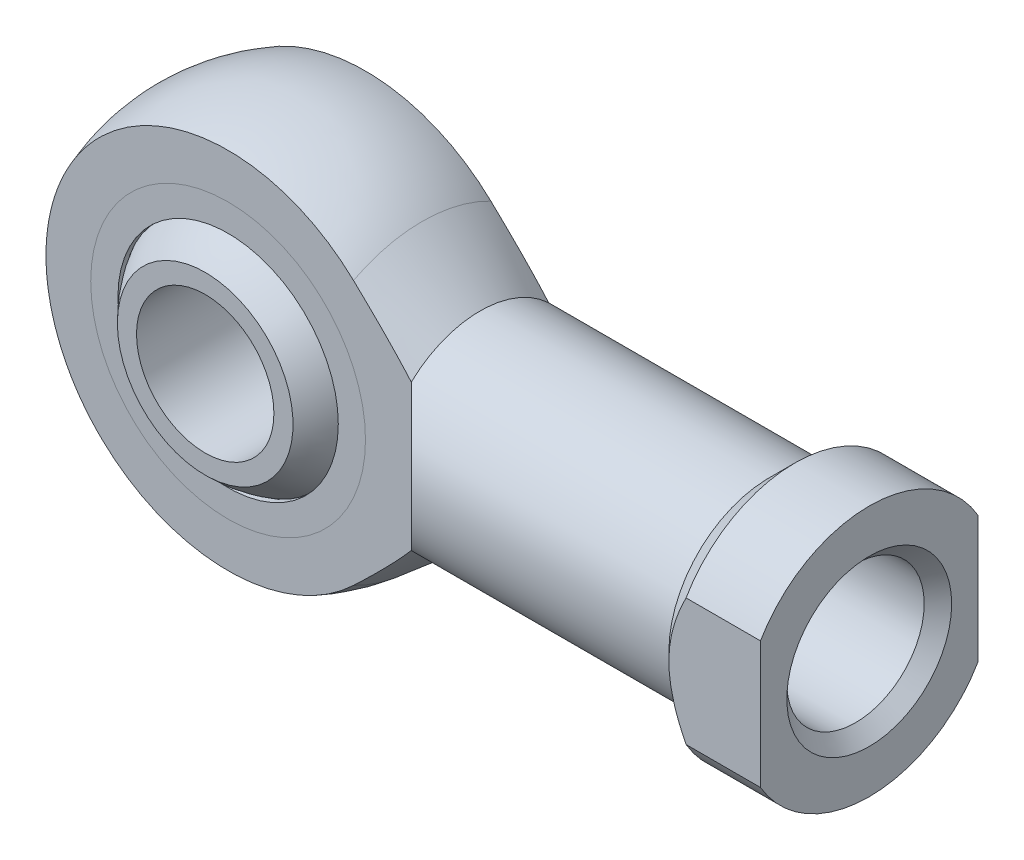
ISO-10303-21;
HEADER;
FILE_DESCRIPTION(('STEP AP214'),'2;1');
FILE_NAME('part.step','',(''),(''),'','','');
FILE_SCHEMA(('AUTOMOTIVE_DESIGN { 1 0 10303 214 1 1 1 1 }'));
ENDSEC;
DATA;
#1=APPLICATION_CONTEXT('core data for automotive mechanical design processes');
#2=APPLICATION_PROTOCOL_DEFINITION('international standard','automotive_design',2000,#1);
#3=PRODUCT_CONTEXT('',#1,'mechanical');
#4=PRODUCT('Part','Part','',(#3));
#5=PRODUCT_RELATED_PRODUCT_CATEGORY('part','',(#4));
#6=PRODUCT_DEFINITION_FORMATION('','',#4);
#7=PRODUCT_DEFINITION_CONTEXT('part definition',#1,'design');
#8=PRODUCT_DEFINITION('design','',#6,#7);
#9=PRODUCT_DEFINITION_SHAPE('','',#8);
#10=(LENGTH_UNIT() NAMED_UNIT(*) SI_UNIT(.MILLI.,.METRE.));
#11=(NAMED_UNIT(*) PLANE_ANGLE_UNIT() SI_UNIT($,.RADIAN.));
#12=(NAMED_UNIT(*) SI_UNIT($,.STERADIAN.) SOLID_ANGLE_UNIT());
#13=UNCERTAINTY_MEASURE_WITH_UNIT(LENGTH_MEASURE(1.E-05),#10,'distance_accuracy_value','');
#14=(GEOMETRIC_REPRESENTATION_CONTEXT(3) GLOBAL_UNCERTAINTY_ASSIGNED_CONTEXT((#13)) GLOBAL_UNIT_ASSIGNED_CONTEXT((#10,
#11,#12)) REPRESENTATION_CONTEXT('',''));
#15=CARTESIAN_POINT('',(0.,0.,0.));
#16=DIRECTION('',(0.,0.,1.));
#17=DIRECTION('',(1.,0.,0.));
#18=AXIS2_PLACEMENT_3D('',#15,#16,#17);
#19=CARTESIAN_POINT('',(0.,0.,0.));
#20=DIRECTION('',(0.,1.,0.));
#21=DIRECTION('',(1.,0.,0.));
#22=AXIS2_PLACEMENT_3D('',#19,#20,#21);
#23=SPHERICAL_SURFACE('',#22,11.085);
#24=CARTESIAN_POINT('',(0.,0.,0.));
#25=DIRECTION('',(0.,0.,-1.));
#26=DIRECTION('',(-1.,0.,0.));
#27=AXIS2_PLACEMENT_3D('',#24,#25,#26);
#28=SPHERICAL_SURFACE('',#27,11.085);
#29=CARTESIAN_POINT('',(0.,0.,8.));
#30=DIRECTION('',(0.,0.,-1.));
#31=DIRECTION('',(-1.,0.,0.));
#32=AXIS2_PLACEMENT_3D('',#29,#30,#31);
#33=CIRCLE('',#32,7.67314961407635);
#34=CARTESIAN_POINT('',(-7.67314961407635,0.,8.));
#35=VERTEX_POINT('',#34);
#36=EDGE_CURVE('P0_E26',#35,#35,#33,.F.);
#37=ORIENTED_EDGE('',*,*,#36,.F.);
#38=EDGE_LOOP('',(#37));
#39=FACE_BOUND('',#38,.T.);
#40=CARTESIAN_POINT('',(0.,0.,-8.));
#41=DIRECTION('',(0.,0.,1.));
#42=DIRECTION('',(1.,0.,0.));
#43=AXIS2_PLACEMENT_3D('',#40,#41,#42);
#44=CIRCLE('',#43,7.67314961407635);
#45=CARTESIAN_POINT('',(7.67314961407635,0.,-8.));
#46=VERTEX_POINT('',#45);
#47=EDGE_CURVE('P0_E10',#46,#46,#44,.F.);
#48=ORIENTED_EDGE('',*,*,#47,.F.);
#49=EDGE_LOOP('',(#48));
#50=FACE_BOUND('',#49,.T.);
#51=ADVANCED_FACE('P0_F14',(#39,#50),#28,.T.);
#52=CARTESIAN_POINT('',(0.,0.,-11.085));
#53=DIRECTION('',(0.,0.,1.));
#54=DIRECTION('',(1.,0.,0.));
#55=AXIS2_PLACEMENT_3D('',#52,#53,#54);
#56=CYLINDRICAL_SURFACE('',#55,6.);
#57=CARTESIAN_POINT('',(0.,0.,8.));
#58=DIRECTION('',(0.,0.,-1.));
#59=DIRECTION('',(-1.,0.,0.));
#60=AXIS2_PLACEMENT_3D('',#57,#58,#59);
#61=CIRCLE('',#60,6.);
#62=CARTESIAN_POINT('',(-6.,0.,8.));
#63=VERTEX_POINT('',#62);
#64=EDGE_CURVE('P0_E17',#63,#63,#61,.F.);
#65=ORIENTED_EDGE('',*,*,#64,.T.);
#66=EDGE_LOOP('',(#65));
#67=FACE_BOUND('',#66,.T.);
#68=CARTESIAN_POINT('',(0.,0.,-8.));
#69=DIRECTION('',(0.,0.,1.));
#70=DIRECTION('',(1.,0.,0.));
#71=AXIS2_PLACEMENT_3D('',#68,#69,#70);
#72=CIRCLE('',#71,6.);
#73=CARTESIAN_POINT('',(6.,0.,-8.));
#74=VERTEX_POINT('',#73);
#75=EDGE_CURVE('P0_E21',#74,#74,#72,.F.);
#76=ORIENTED_EDGE('',*,*,#75,.T.);
#77=EDGE_LOOP('',(#76));
#78=FACE_BOUND('',#77,.T.);
#79=ADVANCED_FACE('P0_F34',(#67,#78),#56,.F.);
#80=CARTESIAN_POINT('',(-11.085,-11.085,-8.));
#81=DIRECTION('',(0.,0.,1.));
#82=DIRECTION('',(1.,0.,0.));
#83=AXIS2_PLACEMENT_3D('',#80,#81,#82);
#84=PLANE('',#83);
#85=ORIENTED_EDGE('',*,*,#47,.T.);
#86=EDGE_LOOP('',(#85));
#87=FACE_BOUND('',#86,.T.);
#88=ORIENTED_EDGE('',*,*,#75,.F.);
#89=EDGE_LOOP('',(#88));
#90=FACE_BOUND('',#89,.T.);
#91=ADVANCED_FACE('P0_F39',(#87,#90),#84,.F.);
#92=CARTESIAN_POINT('',(-11.085,-11.085,8.));
#93=DIRECTION('',(0.,0.,-1.));
#94=DIRECTION('',(-1.,0.,0.));
#95=AXIS2_PLACEMENT_3D('',#92,#93,#94);
#96=PLANE('',#95);
#97=ORIENTED_EDGE('',*,*,#36,.T.);
#98=EDGE_LOOP('',(#97));
#99=FACE_BOUND('',#98,.T.);
#100=ORIENTED_EDGE('',*,*,#64,.F.);
#101=EDGE_LOOP('',(#100));
#102=FACE_BOUND('',#101,.T.);
#103=ADVANCED_FACE('P0_F37',(#99,#102),#96,.F.);
#104=CLOSED_SHELL('',(#51,#79,#91,#103));
#105=MANIFOLD_SOLID_BREP('P0_B1',#104);
#106=CARTESIAN_POINT('',(0.,0.,6.));
#107=DIRECTION('',(0.,0.,1.));
#108=DIRECTION('',(1.,0.,0.));
#109=AXIS2_PLACEMENT_3D('',#106,#107,#108);
#110=PLANE('',#109);
#111=CARTESIAN_POINT('',(0.,0.,6.));
#112=DIRECTION('',(0.,0.,1.));
#113=DIRECTION('',(1.,0.,0.));
#114=AXIS2_PLACEMENT_3D('',#111,#112,#113);
#115=CIRCLE('',#114,12.);
#116=CARTESIAN_POINT('',(12.,0.,6.));
#117=VERTEX_POINT('',#116);
#118=EDGE_CURVE('P1_E10',#117,#117,#115,.T.);
#119=ORIENTED_EDGE('',*,*,#118,.T.);
#120=EDGE_LOOP('',(#119));
#121=FACE_BOUND('',#120,.T.);
#122=CARTESIAN_POINT('',(0.,0.,6.));
#123=DIRECTION('',(0.,0.,1.));
#124=DIRECTION('',(1.,0.,0.));
#125=AXIS2_PLACEMENT_3D('',#122,#123,#124);
#126=CIRCLE('',#125,9.625);
#127=CARTESIAN_POINT('',(9.625,0.,6.));
#128=VERTEX_POINT('',#127);
#129=EDGE_CURVE('P1_E25',#128,#128,#126,.T.);
#130=ORIENTED_EDGE('',*,*,#129,.F.);
#131=EDGE_LOOP('',(#130));
#132=FACE_BOUND('',#131,.T.);
#133=ADVANCED_FACE('P1_F14',(#121,#132),#110,.T.);
#134=CARTESIAN_POINT('',(0.,0.,5.5));
#135=DIRECTION('',(0.,0.,1.));
#136=DIRECTION('',(1.,0.,0.));
#137=AXIS2_PLACEMENT_3D('',#134,#135,#136);
#138=PLANE('',#137);
#139=CARTESIAN_POINT('',(0.,0.,5.5));
#140=DIRECTION('',(0.,0.,1.));
#141=DIRECTION('',(1.,0.,0.));
#142=AXIS2_PLACEMENT_3D('',#139,#140,#141);
#143=CIRCLE('',#142,12.);
#144=CARTESIAN_POINT('',(12.,0.,5.5));
#145=VERTEX_POINT('',#144);
#146=EDGE_CURVE('P1_E18',#145,#145,#143,.T.);
#147=ORIENTED_EDGE('',*,*,#146,.F.);
#148=EDGE_LOOP('',(#147));
#149=FACE_BOUND('',#148,.T.);
#150=CARTESIAN_POINT('',(0.,0.,5.5));
#151=DIRECTION('',(0.,0.,1.));
#152=DIRECTION('',(1.,0.,0.));
#153=AXIS2_PLACEMENT_3D('',#150,#151,#152);
#154=CIRCLE('',#153,9.625);
#155=CARTESIAN_POINT('',(9.625,0.,5.5));
#156=VERTEX_POINT('',#155);
#157=EDGE_CURVE('P1_E27',#156,#156,#154,.T.);
#158=ORIENTED_EDGE('',*,*,#157,.T.);
#159=EDGE_LOOP('',(#158));
#160=FACE_BOUND('',#159,.T.);
#161=ADVANCED_FACE('P1_F37',(#149,#160),#138,.F.);
#162=CARTESIAN_POINT('',(0.,0.,6.));
#163=DIRECTION('',(0.,0.,-1.));
#164=DIRECTION('',(-1.,0.,0.));
#165=AXIS2_PLACEMENT_3D('',#162,#163,#164);
#166=CYLINDRICAL_SURFACE('',#165,12.);
#167=ORIENTED_EDGE('',*,*,#118,.F.);
#168=EDGE_LOOP('',(#167));
#169=FACE_BOUND('',#168,.T.);
#170=ORIENTED_EDGE('',*,*,#146,.T.);
#171=EDGE_LOOP('',(#170));
#172=FACE_BOUND('',#171,.T.);
#173=ADVANCED_FACE('P1_F16',(#169,#172),#166,.T.);
#174=CARTESIAN_POINT('',(0.,0.,6.));
#175=DIRECTION('',(0.,0.,-1.));
#176=DIRECTION('',(-1.,0.,0.));
#177=AXIS2_PLACEMENT_3D('',#174,#175,#176);
#178=CYLINDRICAL_SURFACE('',#177,9.625);
#179=ORIENTED_EDGE('',*,*,#129,.T.);
#180=EDGE_LOOP('',(#179));
#181=FACE_BOUND('',#180,.T.);
#182=ORIENTED_EDGE('',*,*,#157,.F.);
#183=EDGE_LOOP('',(#182));
#184=FACE_BOUND('',#183,.T.);
#185=ADVANCED_FACE('P1_F33',(#181,#184),#178,.F.);
#186=CLOSED_SHELL('',(#133,#161,#173,#185));
#187=MANIFOLD_SOLID_BREP('P1_B1',#186);
#188=CARTESIAN_POINT('',(0.,0.,-5.5));
#189=DIRECTION('',(0.,0.,1.));
#190=DIRECTION('',(1.,0.,0.));
#191=AXIS2_PLACEMENT_3D('',#188,#189,#190);
#192=PLANE('',#191);
#193=CARTESIAN_POINT('',(0.,0.,-5.5));
#194=DIRECTION('',(0.,0.,1.));
#195=DIRECTION('',(1.,0.,0.));
#196=AXIS2_PLACEMENT_3D('',#193,#194,#195);
#197=CIRCLE('',#196,12.);
#198=CARTESIAN_POINT('',(12.,0.,-5.5));
#199=VERTEX_POINT('',#198);
#200=EDGE_CURVE('P2_E10',#199,#199,#197,.T.);
#201=ORIENTED_EDGE('',*,*,#200,.T.);
#202=EDGE_LOOP('',(#201));
#203=FACE_BOUND('',#202,.T.);
#204=CARTESIAN_POINT('',(0.,0.,-5.5));
#205=DIRECTION('',(0.,0.,1.));
#206=DIRECTION('',(1.,0.,0.));
#207=AXIS2_PLACEMENT_3D('',#204,#205,#206);
#208=CIRCLE('',#207,9.625);
#209=CARTESIAN_POINT('',(9.625,0.,-5.5));
#210=VERTEX_POINT('',#209);
#211=EDGE_CURVE('P2_E25',#210,#210,#208,.T.);
#212=ORIENTED_EDGE('',*,*,#211,.F.);
#213=EDGE_LOOP('',(#212));
#214=FACE_BOUND('',#213,.T.);
#215=ADVANCED_FACE('P2_F14',(#203,#214),#192,.T.);
#216=CARTESIAN_POINT('',(0.,0.,-6.));
#217=DIRECTION('',(0.,0.,1.));
#218=DIRECTION('',(1.,0.,0.));
#219=AXIS2_PLACEMENT_3D('',#216,#217,#218);
#220=PLANE('',#219);
#221=CARTESIAN_POINT('',(0.,0.,-6.));
#222=DIRECTION('',(0.,0.,1.));
#223=DIRECTION('',(1.,0.,0.));
#224=AXIS2_PLACEMENT_3D('',#221,#222,#223);
#225=CIRCLE('',#224,12.);
#226=CARTESIAN_POINT('',(12.,0.,-6.));
#227=VERTEX_POINT('',#226);
#228=EDGE_CURVE('P2_E18',#227,#227,#225,.T.);
#229=ORIENTED_EDGE('',*,*,#228,.F.);
#230=EDGE_LOOP('',(#229));
#231=FACE_BOUND('',#230,.T.);
#232=CARTESIAN_POINT('',(0.,0.,-6.));
#233=DIRECTION('',(0.,0.,1.));
#234=DIRECTION('',(1.,0.,0.));
#235=AXIS2_PLACEMENT_3D('',#232,#233,#234);
#236=CIRCLE('',#235,9.625);
#237=CARTESIAN_POINT('',(9.625,0.,-6.));
#238=VERTEX_POINT('',#237);
#239=EDGE_CURVE('P2_E27',#238,#238,#236,.T.);
#240=ORIENTED_EDGE('',*,*,#239,.T.);
#241=EDGE_LOOP('',(#240));
#242=FACE_BOUND('',#241,.T.);
#243=ADVANCED_FACE('P2_F37',(#231,#242),#220,.F.);
#244=CARTESIAN_POINT('',(0.,0.,-5.5));
#245=DIRECTION('',(0.,0.,-1.));
#246=DIRECTION('',(-1.,0.,0.));
#247=AXIS2_PLACEMENT_3D('',#244,#245,#246);
#248=CYLINDRICAL_SURFACE('',#247,12.);
#249=ORIENTED_EDGE('',*,*,#200,.F.);
#250=EDGE_LOOP('',(#249));
#251=FACE_BOUND('',#250,.T.);
#252=ORIENTED_EDGE('',*,*,#228,.T.);
#253=EDGE_LOOP('',(#252));
#254=FACE_BOUND('',#253,.T.);
#255=ADVANCED_FACE('P2_F16',(#251,#254),#248,.T.);
#256=CARTESIAN_POINT('',(0.,0.,-5.5));
#257=DIRECTION('',(0.,0.,-1.));
#258=DIRECTION('',(-1.,0.,0.));
#259=AXIS2_PLACEMENT_3D('',#256,#257,#258);
#260=CYLINDRICAL_SURFACE('',#259,9.625);
#261=ORIENTED_EDGE('',*,*,#211,.T.);
#262=EDGE_LOOP('',(#261));
#263=FACE_BOUND('',#262,.T.);
#264=ORIENTED_EDGE('',*,*,#239,.F.);
#265=EDGE_LOOP('',(#264));
#266=FACE_BOUND('',#265,.T.);
#267=ADVANCED_FACE('P2_F33',(#263,#266),#260,.F.);
#268=CLOSED_SHELL('',(#215,#243,#255,#267));
#269=MANIFOLD_SOLID_BREP('P2_B1',#268);
#270=CARTESIAN_POINT('',(0.,0.,0.));
#271=DIRECTION('',(0.,1.,0.));
#272=DIRECTION('',(1.,0.,0.));
#273=AXIS2_PLACEMENT_3D('',#270,#271,#272);
#274=SPHERICAL_SURFACE('',#273,11.085);
#275=CARTESIAN_POINT('',(0.,0.,0.));
#276=DIRECTION('',(0.,0.,1.));
#277=DIRECTION('',(1.,0.,0.));
#278=AXIS2_PLACEMENT_3D('',#275,#276,#277);
#279=SPHERICAL_SURFACE('',#278,11.085);
#280=CARTESIAN_POINT('',(0.,0.,5.5));
#281=DIRECTION('',(0.,0.,1.));
#282=DIRECTION('',(1.,0.,0.));
#283=AXIS2_PLACEMENT_3D('',#280,#281,#282);
#284=CIRCLE('',#283,9.6243038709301);
#285=CARTESIAN_POINT('',(9.6243038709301,0.,5.5));
#286=VERTEX_POINT('',#285);
#287=EDGE_CURVE('P3_E73',#286,#286,#284,.F.);
#288=ORIENTED_EDGE('',*,*,#287,.F.);
#289=EDGE_LOOP('',(#288));
#290=FACE_BOUND('',#289,.T.);
#291=CARTESIAN_POINT('',(0.,0.,-5.5));
#292=DIRECTION('',(0.,0.,-1.));
#293=DIRECTION('',(-1.,0.,0.));
#294=AXIS2_PLACEMENT_3D('',#291,#292,#293);
#295=CIRCLE('',#294,9.6243038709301);
#296=CARTESIAN_POINT('',(-9.6243038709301,0.,-5.5));
#297=VERTEX_POINT('',#296);
#298=EDGE_CURVE('P3_E20',#297,#297,#295,.F.);
#299=ORIENTED_EDGE('',*,*,#298,.F.);
#300=EDGE_LOOP('',(#299));
#301=FACE_BOUND('',#300,.T.);
#302=ADVANCED_FACE('P3_F16',(#290,#301),#279,.F.);
#303=CARTESIAN_POINT('',(-16.,-17.,-6.));
#304=DIRECTION('',(0.,0.,1.));
#305=DIRECTION('',(1.,0.,0.));
#306=AXIS2_PLACEMENT_3D('',#303,#304,#305);
#307=PLANE('',#306);
#308=CARTESIAN_POINT('',(0.,0.,-6.));
#309=DIRECTION('',(0.,0.,1.));
#310=DIRECTION('',(1.,0.,0.));
#311=AXIS2_PLACEMENT_3D('',#308,#309,#310);
#312=CIRCLE('',#311,15.9059737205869);
#313=CARTESIAN_POINT('',(10.9519919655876,11.5348980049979,-6.));
#314=VERTEX_POINT('',#313);
#315=CARTESIAN_POINT('',(10.9519919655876,-11.5348980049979,-6.));
#316=VERTEX_POINT('',#315);
#317=EDGE_CURVE('P3_E11',#314,#316,#312,.T.);
#318=ORIENTED_EDGE('',*,*,#317,.F.);
#319=CARTESIAN_POINT('',(-32.7884547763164,-49.4833858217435,-6.));
#320=CARTESIAN_POINT('',(-31.8347602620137,-48.6741771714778,-6.));
#321=CARTESIAN_POINT('',(-30.8812049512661,-47.8648044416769,-6.));
#322=CARTESIAN_POINT('',(-28.974424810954,-46.2456693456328,-6.));
#323=CARTESIAN_POINT('',(-28.021199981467,-45.4359069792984,-6.));
#324=CARTESIAN_POINT('',(-25.1619543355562,-43.0058199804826,-6.));
#325=CARTESIAN_POINT('',(-23.2565081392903,-41.3848191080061,-6.));
#326=CARTESIAN_POINT('',(-19.4439820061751,-38.1370821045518,-6.));
#327=CARTESIAN_POINT('',(-17.5369063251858,-36.510340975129,-6.));
#328=CARTESIAN_POINT('',(-14.6787608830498,-34.0674826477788,-6.));
#329=CARTESIAN_POINT('',(-13.7264918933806,-33.2527686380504,-6.));
#330=CARTESIAN_POINT('',(-11.8229549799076,-31.6221721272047,-6.));
#331=CARTESIAN_POINT('',(-10.8716870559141,-30.8062896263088,-6.));
#332=CARTESIAN_POINT('',(-8.95351223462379,-29.1585408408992,-6.));
#333=CARTESIAN_POINT('',(-7.98662793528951,-28.32664824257,-6.));
#334=CARTESIAN_POINT('',(-6.05454821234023,-26.660904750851,-6.));
#335=CARTESIAN_POINT('',(-5.08935278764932,-25.8270538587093,-6.));
#336=CARTESIAN_POINT('',(-3.16097671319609,-24.1565798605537,-6.));
#337=CARTESIAN_POINT('',(-2.19779657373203,-23.3199561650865,-6.));
#338=CARTESIAN_POINT('',(-0.274509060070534,-21.6432180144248,-6.));
#339=CARTESIAN_POINT('',(0.685598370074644,-20.8031036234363,-6.));
#340=CARTESIAN_POINT('',(2.60039592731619,-19.1189500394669,-6.));
#341=CARTESIAN_POINT('',(3.55509105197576,-18.274916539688,-6.));
#342=CARTESIAN_POINT('',(4.98234991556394,-17.0034206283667,-6.));
#343=CARTESIAN_POINT('',(5.4573239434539,-16.5786644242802,-6.));
#344=CARTESIAN_POINT('',(6.40524840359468,-15.7269017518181,-6.));
#345=CARTESIAN_POINT('',(6.87819884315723,-15.2998952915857,-6.));
#346=CARTESIAN_POINT('',(7.82135879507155,-14.4432252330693,-6.));
#347=CARTESIAN_POINT('',(8.29156928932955,-14.0135627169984,-6.));
#348=CARTESIAN_POINT('',(9.22866677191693,-13.1506321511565,-6.));
#349=CARTESIAN_POINT('',(9.69555378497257,-12.717364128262,-6.));
#350=CARTESIAN_POINT('',(10.6248692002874,-11.8461718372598,-6.));
#351=CARTESIAN_POINT('',(11.0872981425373,-11.4082481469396,-6.));
#352=CARTESIAN_POINT('',(11.7763758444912,-10.7466220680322,-6.));
#353=CARTESIAN_POINT('',(12.0053040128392,-10.5252933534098,-6.));
#354=CARTESIAN_POINT('',(12.4613433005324,-10.0807728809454,-6.));
#355=CARTESIAN_POINT('',(12.6884544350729,-9.8575811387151,-6.));
#356=CARTESIAN_POINT('',(13.0702227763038,-9.47873212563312,-6.));
#357=CARTESIAN_POINT('',(13.2254530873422,-9.32365238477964,-6.));
#358=CARTESIAN_POINT('',(13.5347292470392,-9.01231062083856,-6.));
#359=CARTESIAN_POINT('',(13.688775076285,-8.85604857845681,-6.));
#360=CARTESIAN_POINT('',(13.9955176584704,-8.54217471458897,-6.));
#361=CARTESIAN_POINT('',(14.1482142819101,-8.38456276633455,-6.));
#362=CARTESIAN_POINT('',(14.4520188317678,-8.06781888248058,-6.));
#363=CARTESIAN_POINT('',(14.6031267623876,-7.90868695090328,-6.));
#364=CARTESIAN_POINT('',(15.0544219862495,-7.42793291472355,-6.));
#365=CARTESIAN_POINT('',(15.3518514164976,-7.10369454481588,-6.));
#366=CARTESIAN_POINT('',(15.7902028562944,-6.61045174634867,-6.));
#367=CARTESIAN_POINT('',(15.935012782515,-6.44490005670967,-6.));
#368=CARTESIAN_POINT('',(16.2214958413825,-6.11110571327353,-6.));
#369=CARTESIAN_POINT('',(16.3631690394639,-5.942863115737,-6.));
#370=CARTESIAN_POINT('',(16.7071374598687,-5.52499850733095,-6.));
#371=CARTESIAN_POINT('',(16.9072863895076,-5.27359936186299,-6.));
#372=CARTESIAN_POINT('',(17.2967423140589,-4.76227187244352,-6.));
#373=CARTESIAN_POINT('',(17.4860448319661,-4.50234007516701,-6.));
#374=CARTESIAN_POINT('',(17.758244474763,-4.10484162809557,-6.));
#375=CARTESIAN_POINT('',(17.8469231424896,-3.9712338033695,-6.));
#376=CARTESIAN_POINT('',(18.0196860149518,-3.70108846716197,-6.));
#377=CARTESIAN_POINT('',(18.103770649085,-3.56455123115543,-6.));
#378=CARTESIAN_POINT('',(18.2663776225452,-3.2883463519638,-6.));
#379=CARTESIAN_POINT('',(18.3449051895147,-3.14868181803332,-6.));
#380=CARTESIAN_POINT('',(18.4953597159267,-2.86585616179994,-6.));
#381=CARTESIAN_POINT('',(18.5672855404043,-2.72269444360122,-6.));
#382=CARTESIAN_POINT('',(18.7811774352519,-2.2662219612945,-6.));
#383=CARTESIAN_POINT('',(18.9090270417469,-1.94580576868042,-6.));
#384=CARTESIAN_POINT('',(19.0611029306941,-1.45362694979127,-6.));
#385=CARTESIAN_POINT('',(19.1051404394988,-1.28790982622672,-6.));
#386=CARTESIAN_POINT('',(19.178072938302,-0.953208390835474,-6.));
#387=CARTESIAN_POINT('',(19.2069795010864,-0.784226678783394,-6.));
#388=CARTESIAN_POINT('',(19.2398537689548,-0.512402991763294,-6.));
#389=CARTESIAN_POINT('',(19.2491730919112,-0.410185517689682,-6.));
#390=CARTESIAN_POINT('',(19.2616325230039,-0.205316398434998,-6.));
#391=CARTESIAN_POINT('',(19.2647693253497,-0.102664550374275,-6.));
#392=CARTESIAN_POINT('',(19.2647624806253,0.154934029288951,-6.));
#393=CARTESIAN_POINT('',(19.2576081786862,0.309896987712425,-6.));
#394=CARTESIAN_POINT('',(19.2293441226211,0.618593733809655,-6.));
#395=CARTESIAN_POINT('',(19.20822694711,0.772326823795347,-6.));
#396=CARTESIAN_POINT('',(19.1530050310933,1.07765906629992,-6.));
#397=CARTESIAN_POINT('',(19.1188805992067,1.22925462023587,-6.));
#398=CARTESIAN_POINT('',(19.0390719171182,1.52932831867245,-6.));
#399=CARTESIAN_POINT('',(18.9933874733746,1.67780641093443,-6.));
#400=CARTESIAN_POINT('',(18.8604660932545,2.06264879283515,-6.));
#401=CARTESIAN_POINT('',(18.7650646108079,2.29619318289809,-6.));
#402=CARTESIAN_POINT('',(18.5542304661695,2.75407308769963,-6.));
#403=CARTESIAN_POINT('',(18.4387807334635,2.97840055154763,-6.));
#404=CARTESIAN_POINT('',(18.2540806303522,3.30910525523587,-6.));
#405=CARTESIAN_POINT('',(18.1904084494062,3.41865891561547,-6.));
#406=CARTESIAN_POINT('',(18.0597723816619,3.63579123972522,-6.));
#407=CARTESIAN_POINT('',(17.9928084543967,3.74336987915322,-6.));
#408=CARTESIAN_POINT('',(17.8560679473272,3.95664587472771,-6.));
#409=CARTESIAN_POINT('',(17.7862927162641,4.06234409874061,-6.));
#410=CARTESIAN_POINT('',(17.6442690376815,4.27205566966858,-6.));
#411=CARTESIAN_POINT('',(17.572020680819,4.37606907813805,-6.));
#412=CARTESIAN_POINT('',(17.3349745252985,4.70985139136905,-6.));
#413=CARTESIAN_POINT('',(17.1658821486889,4.9365761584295,-6.));
#414=CARTESIAN_POINT('',(16.819655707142,5.38382394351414,-6.));
#415=CARTESIAN_POINT('',(16.6425197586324,5.60434548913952,-6.));
#416=CARTESIAN_POINT('',(16.2819510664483,6.04046702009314,-6.));
#417=CARTESIAN_POINT('',(16.0985132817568,6.25606282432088,-6.));
#418=CARTESIAN_POINT('',(15.7268459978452,6.68303677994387,-6.));
#419=CARTESIAN_POINT('',(15.538616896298,6.89441527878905,-6.));
#420=CARTESIAN_POINT('',(15.1577996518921,7.31428655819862,-6.));
#421=CARTESIAN_POINT('',(14.9652007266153,7.5227695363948,-6.));
#422=CARTESIAN_POINT('',(14.576894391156,7.93682119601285,-6.));
#423=CARTESIAN_POINT('',(14.3811869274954,8.14238982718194,-6.));
#424=CARTESIAN_POINT('',(13.9873183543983,8.55097921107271,-6.));
#425=CARTESIAN_POINT('',(13.7891584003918,8.75400107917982,-6.));
#426=CARTESIAN_POINT('',(13.3907256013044,9.15796257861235,-6.));
#427=CARTESIAN_POINT('',(13.1904527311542,9.35890218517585,-6.));
#428=CARTESIAN_POINT('',(12.5843265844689,9.96171646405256,-6.));
#429=CARTESIAN_POINT('',(12.1757848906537,10.3608881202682,-6.));
#430=CARTESIAN_POINT('',(11.353528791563,11.1539303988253,-6.));
#431=CARTESIAN_POINT('',(10.9398138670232,11.5478004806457,-6.));
#432=CARTESIAN_POINT('',(10.1092873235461,12.3307399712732,-6.));
#433=CARTESIAN_POINT('',(9.69248268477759,12.7198167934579,-6.));
#434=CARTESIAN_POINT('',(8.85594309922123,13.4947714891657,-6.));
#435=CARTESIAN_POINT('',(8.43620826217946,13.8806494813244,-6.));
#436=CARTESIAN_POINT('',(7.59092273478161,14.6530718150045,-6.));
#437=CARTESIAN_POINT('',(7.16535271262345,15.0395949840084,-6.));
#438=CARTESIAN_POINT('',(6.31232948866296,15.8105585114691,-6.));
#439=CARTESIAN_POINT('',(5.8848762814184,16.1949988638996,-6.));
#440=CARTESIAN_POINT('',(4.60023356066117,17.3457918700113,-6.));
#441=CARTESIAN_POINT('',(3.74077132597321,18.109607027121,-6.));
#442=CARTESIAN_POINT('',(2.01766849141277,19.6325992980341,-6.));
#443=CARTESIAN_POINT('',(1.1540276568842,20.3917761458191,-6.));
#444=CARTESIAN_POINT('',(-0.576230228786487,21.9067329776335,-6.));
#445=CARTESIAN_POINT('',(-1.44284728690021,22.6625129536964,-6.));
#446=CARTESIAN_POINT('',(-3.17912451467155,24.1722668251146,-6.));
#447=CARTESIAN_POINT('',(-4.04878681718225,24.9262382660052,-6.));
#448=CARTESIAN_POINT('',(-5.78979694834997,26.4322347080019,-6.));
#449=CARTESIAN_POINT('',(-6.66114477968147,27.1842597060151,-6.));
#450=CARTESIAN_POINT('',(-8.40512477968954,28.686761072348,-6.));
#451=CARTESIAN_POINT('',(-9.27775690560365,29.437237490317,-6.));
#452=CARTESIAN_POINT('',(-11.0240668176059,30.9369729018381,-6.));
#453=CARTESIAN_POINT('',(-11.8977446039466,31.6862318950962,-6.));
#454=CARTESIAN_POINT('',(-14.4367891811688,33.8612308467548,-6.));
#455=CARTESIAN_POINT('',(-16.1032573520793,35.2856849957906,-6.));
#456=CARTESIAN_POINT('',(-19.4383061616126,38.132151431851,-6.));
#457=CARTESIAN_POINT('',(-21.1068868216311,39.5541636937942,-6.));
#458=CARTESIAN_POINT('',(-24.4436700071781,42.3948035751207,-6.));
#459=CARTESIAN_POINT('',(-26.1118708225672,43.8134332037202,-6.));
#460=CARTESIAN_POINT('',(-29.4494014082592,46.6493254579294,-6.));
#461=CARTESIAN_POINT('',(-31.1187311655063,48.0665880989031,-6.));
#462=CARTESIAN_POINT('',(-32.7884547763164,49.4833858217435,-6.));
#463=B_SPLINE_CURVE_WITH_KNOTS('',3,(#319,#320,#321,#322,#323,#324,#325,#326,#327,#328,#329,
#330,#331,#332,#333,#334,#335,#336,#337,#338,#339,#340,#341,#342,#343,#344,#345,#346,#347,#348,
#349,#350,#351,#352,#353,#354,#355,#356,#357,#358,#359,#360,#361,#362,#363,#364,#365,#366,#367,
#368,#369,#370,#371,#372,#373,#374,#375,#376,#377,#378,#379,#380,#381,#382,#383,#384,#385,#386,
#387,#388,#389,#390,#391,#392,#393,#394,#395,#396,#397,#398,#399,#400,#401,#402,#403,#404,#405,
#406,#407,#408,#409,#410,#411,#412,#413,#414,#415,#416,#417,#418,#419,#420,#421,#422,#423,#424,
#425,#426,#427,#428,#429,#430,#431,#432,#433,#434,#435,#436,#437,#438,#439,#440,#441,#442,#443,
#444,#445,#446,#447,#448,#449,#450,#451,#452,#453,#454,#455,#456,#457,#458,#459,#460,#461,#462),
.UNSPECIFIED.,.F.,.F.,(4,2,2,2,2,2,2,2,2,2,2,2,2,2,2,2,2,2,2,2,2,2,2,2,2,2,2,2,2,2,2,2,2,2,2,2,
2,2,2,2,2,2,2,2,2,2,2,2,2,2,2,2,2,2,2,2,2,2,2,2,2,2,2,2,2,2,2,2,2,2,2,4),(0.,3.75222157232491,
7.50444402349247,15.0094624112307,22.5293668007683,26.2890437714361,30.0487200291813,
33.8752301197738,37.7017377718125,41.5291190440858,45.3564302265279,49.1792952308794,
51.0908764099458,53.0024506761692,54.9132915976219,56.8241182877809,58.7347105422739,
59.6899776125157,60.6452366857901,61.3034983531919,61.9617707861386,62.62010572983,
63.2784389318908,64.5982259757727,65.2580405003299,65.9178412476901,66.8816641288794,
67.8458820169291,68.3268827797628,68.8078385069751,69.2883356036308,69.7689151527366,
70.7998394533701,71.3136962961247,71.8271595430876,72.134915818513,72.4428366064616,
72.9075287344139,73.3724680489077,73.8381140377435,74.3037678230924,75.0592568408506,
75.8153923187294,76.195484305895,76.5755809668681,76.9554973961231,77.3353999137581,
78.1836356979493,79.0320711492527,79.881201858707,80.7302623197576,81.5817137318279,
82.4331798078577,83.2842589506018,84.1353482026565,85.8488064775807,87.5624381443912,
89.2729607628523,90.9834196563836,92.7081110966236,94.4328075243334,97.8822424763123,
101.331873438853,104.781512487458,108.23448867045,111.687470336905,115.140339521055,
118.593209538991,125.170110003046,131.747077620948,138.316600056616,144.886047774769),.UNSPECIFIED.);
#464=CARTESIAN_POINT('',(16.,6.3688696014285,-6.));
#465=VERTEX_POINT('',#464);
#466=EDGE_CURVE('P3_E102',#465,#314,#463,.T.);
#467=ORIENTED_EDGE('',*,*,#466,.F.);
#468=DIRECTION('',(0.,1.,0.));
#469=VECTOR('',#468,1.);
#470=CARTESIAN_POINT('',(16.,-17.,-6.));
#471=LINE('',#470,#469);
#472=CARTESIAN_POINT('',(16.,-6.3688696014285,-6.));
#473=VERTEX_POINT('',#472);
#474=EDGE_CURVE('P3_E64',#473,#465,#471,.T.);
#475=ORIENTED_EDGE('',*,*,#474,.F.);
#476=EDGE_CURVE('P3_E33',#316,#473,#463,.T.);
#477=ORIENTED_EDGE('',*,*,#476,.F.);
#478=EDGE_LOOP('',(#318,#467,#475,#477));
#479=FACE_BOUND('',#478,.T.);
#480=CARTESIAN_POINT('',(0.,0.,-6.));
#481=DIRECTION('',(0.,0.,1.));
#482=DIRECTION('',(1.,0.,0.));
#483=AXIS2_PLACEMENT_3D('',#480,#481,#482);
#484=CIRCLE('',#483,12.);
#485=CARTESIAN_POINT('',(12.,0.,-6.));
#486=VERTEX_POINT('',#485);
#487=EDGE_CURVE('P3_E95',#486,#486,#484,.T.);
#488=ORIENTED_EDGE('',*,*,#487,.T.);
#489=EDGE_LOOP('',(#488));
#490=FACE_BOUND('',#489,.T.);
#491=ADVANCED_FACE('P3_F115',(#479,#490),#307,.F.);
#492=CARTESIAN_POINT('',(16.,0.,0.));
#493=DIRECTION('',(-1.,0.,0.));
#494=DIRECTION('',(0.,0.,1.));
#495=AXIS2_PLACEMENT_3D('',#492,#493,#494);
#496=CONICAL_SURFACE('',#495,8.75,0.700022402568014);
#497=CARTESIAN_POINT('',(10.9519919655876,0.,0.));
#498=DIRECTION('',(-1.,0.,0.));
#499=DIRECTION('',(0.,0.,1.));
#500=AXIS2_PLACEMENT_3D('',#497,#498,#499);
#501=CIRCLE('',#500,13.0020718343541);
#502=CARTESIAN_POINT('',(10.9519919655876,-11.5348980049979,6.));
#503=VERTEX_POINT('',#502);
#504=EDGE_CURVE('P3_E79',#316,#503,#501,.T.);
#505=ORIENTED_EDGE('',*,*,#504,.F.);
#506=ORIENTED_EDGE('',*,*,#476,.T.);
#507=CARTESIAN_POINT('',(16.,0.,0.));
#508=DIRECTION('',(-1.,0.,0.));
#509=DIRECTION('',(0.,0.,1.));
#510=AXIS2_PLACEMENT_3D('',#507,#508,#509);
#511=CIRCLE('',#510,8.75);
#512=CARTESIAN_POINT('',(16.,-6.3688696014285,6.));
#513=VERTEX_POINT('',#512);
#514=EDGE_CURVE('P3_E70',#473,#513,#511,.T.);
#515=ORIENTED_EDGE('',*,*,#514,.T.);
#516=CARTESIAN_POINT('',(-32.7884547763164,49.4833858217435,6.));
#517=CARTESIAN_POINT('',(-31.8347602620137,48.6741771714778,6.));
#518=CARTESIAN_POINT('',(-30.8812049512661,47.8648044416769,6.));
#519=CARTESIAN_POINT('',(-28.974424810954,46.2456693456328,6.));
#520=CARTESIAN_POINT('',(-28.021199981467,45.4359069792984,6.));
#521=CARTESIAN_POINT('',(-25.1619543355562,43.0058199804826,6.));
#522=CARTESIAN_POINT('',(-23.2565081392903,41.3848191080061,6.));
#523=CARTESIAN_POINT('',(-19.4439820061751,38.1370821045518,6.));
#524=CARTESIAN_POINT('',(-17.5369063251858,36.510340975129,6.));
#525=CARTESIAN_POINT('',(-14.6787608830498,34.0674826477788,6.));
#526=CARTESIAN_POINT('',(-13.7264918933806,33.2527686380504,6.));
#527=CARTESIAN_POINT('',(-11.8229549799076,31.6221721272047,6.));
#528=CARTESIAN_POINT('',(-10.8716870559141,30.8062896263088,6.));
#529=CARTESIAN_POINT('',(-8.95351223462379,29.1585408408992,6.));
#530=CARTESIAN_POINT('',(-7.98662793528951,28.32664824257,6.));
#531=CARTESIAN_POINT('',(-6.05454821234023,26.660904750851,6.));
#532=CARTESIAN_POINT('',(-5.08935278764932,25.8270538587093,6.));
#533=CARTESIAN_POINT('',(-3.16097671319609,24.1565798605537,6.));
#534=CARTESIAN_POINT('',(-2.19779657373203,23.3199561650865,6.));
#535=CARTESIAN_POINT('',(-0.274509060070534,21.6432180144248,6.));
#536=CARTESIAN_POINT('',(0.685598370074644,20.8031036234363,6.));
#537=CARTESIAN_POINT('',(2.60039592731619,19.1189500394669,6.));
#538=CARTESIAN_POINT('',(3.55509105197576,18.274916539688,6.));
#539=CARTESIAN_POINT('',(4.98234991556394,17.0034206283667,6.));
#540=CARTESIAN_POINT('',(5.4573239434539,16.5786644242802,6.));
#541=CARTESIAN_POINT('',(6.40524840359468,15.7269017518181,6.));
#542=CARTESIAN_POINT('',(6.87819884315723,15.2998952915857,6.));
#543=CARTESIAN_POINT('',(7.82135879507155,14.4432252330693,6.));
#544=CARTESIAN_POINT('',(8.29156928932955,14.0135627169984,6.));
#545=CARTESIAN_POINT('',(9.22866677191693,13.1506321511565,6.));
#546=CARTESIAN_POINT('',(9.69555378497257,12.717364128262,6.));
#547=CARTESIAN_POINT('',(10.6248692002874,11.8461718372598,6.));
#548=CARTESIAN_POINT('',(11.0872981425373,11.4082481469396,6.));
#549=CARTESIAN_POINT('',(11.7763758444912,10.7466220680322,6.));
#550=CARTESIAN_POINT('',(12.0053040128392,10.5252933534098,6.));
#551=CARTESIAN_POINT('',(12.4613433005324,10.0807728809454,6.));
#552=CARTESIAN_POINT('',(12.6884544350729,9.8575811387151,6.));
#553=CARTESIAN_POINT('',(13.0702227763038,9.47873212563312,6.));
#554=CARTESIAN_POINT('',(13.2254530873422,9.32365238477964,6.));
#555=CARTESIAN_POINT('',(13.5347292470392,9.01231062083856,6.));
#556=CARTESIAN_POINT('',(13.688775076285,8.85604857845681,6.));
#557=CARTESIAN_POINT('',(13.9955176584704,8.54217471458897,6.));
#558=CARTESIAN_POINT('',(14.1482142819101,8.38456276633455,6.));
#559=CARTESIAN_POINT('',(14.4520188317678,8.06781888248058,6.));
#560=CARTESIAN_POINT('',(14.6031267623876,7.90868695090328,6.));
#561=CARTESIAN_POINT('',(15.0544219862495,7.42793291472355,6.));
#562=CARTESIAN_POINT('',(15.3518514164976,7.10369454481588,6.));
#563=CARTESIAN_POINT('',(15.7902028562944,6.61045174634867,6.));
#564=CARTESIAN_POINT('',(15.935012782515,6.44490005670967,6.));
#565=CARTESIAN_POINT('',(16.2214958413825,6.11110571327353,6.));
#566=CARTESIAN_POINT('',(16.3631690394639,5.942863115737,6.));
#567=CARTESIAN_POINT('',(16.7071374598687,5.52499850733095,6.));
#568=CARTESIAN_POINT('',(16.9072863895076,5.27359936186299,6.));
#569=CARTESIAN_POINT('',(17.2967423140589,4.76227187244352,6.));
#570=CARTESIAN_POINT('',(17.4860448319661,4.50234007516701,6.));
#571=CARTESIAN_POINT('',(17.758244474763,4.10484162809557,6.));
#572=CARTESIAN_POINT('',(17.8469231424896,3.9712338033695,6.));
#573=CARTESIAN_POINT('',(18.0196860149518,3.70108846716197,6.));
#574=CARTESIAN_POINT('',(18.103770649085,3.56455123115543,6.));
#575=CARTESIAN_POINT('',(18.2663776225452,3.2883463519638,6.));
#576=CARTESIAN_POINT('',(18.3449051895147,3.14868181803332,6.));
#577=CARTESIAN_POINT('',(18.4953597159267,2.86585616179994,6.));
#578=CARTESIAN_POINT('',(18.5672855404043,2.72269444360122,6.));
#579=CARTESIAN_POINT('',(18.7811774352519,2.2662219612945,6.));
#580=CARTESIAN_POINT('',(18.9090270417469,1.94580576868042,6.));
#581=CARTESIAN_POINT('',(19.0611029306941,1.45362694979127,6.));
#582=CARTESIAN_POINT('',(19.1051404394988,1.28790982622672,6.));
#583=CARTESIAN_POINT('',(19.178072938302,0.953208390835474,6.));
#584=CARTESIAN_POINT('',(19.2069795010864,0.784226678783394,6.));
#585=CARTESIAN_POINT('',(19.2398537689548,0.512402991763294,6.));
#586=CARTESIAN_POINT('',(19.2491730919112,0.410185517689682,6.));
#587=CARTESIAN_POINT('',(19.2616325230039,0.205316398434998,6.));
#588=CARTESIAN_POINT('',(19.2647693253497,0.102664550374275,6.));
#589=CARTESIAN_POINT('',(19.2647624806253,-0.154934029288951,6.));
#590=CARTESIAN_POINT('',(19.2576081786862,-0.309896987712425,6.));
#591=CARTESIAN_POINT('',(19.2293441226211,-0.618593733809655,6.));
#592=CARTESIAN_POINT('',(19.20822694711,-0.772326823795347,6.));
#593=CARTESIAN_POINT('',(19.1530050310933,-1.07765906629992,6.));
#594=CARTESIAN_POINT('',(19.1188805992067,-1.22925462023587,6.));
#595=CARTESIAN_POINT('',(19.0390719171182,-1.52932831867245,6.));
#596=CARTESIAN_POINT('',(18.9933874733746,-1.67780641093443,6.));
#597=CARTESIAN_POINT('',(18.8604660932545,-2.06264879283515,6.));
#598=CARTESIAN_POINT('',(18.7650646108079,-2.29619318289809,6.));
#599=CARTESIAN_POINT('',(18.5542304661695,-2.75407308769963,6.));
#600=CARTESIAN_POINT('',(18.4387807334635,-2.97840055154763,6.));
#601=CARTESIAN_POINT('',(18.2540806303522,-3.30910525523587,6.));
#602=CARTESIAN_POINT('',(18.1904084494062,-3.41865891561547,6.));
#603=CARTESIAN_POINT('',(18.0597723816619,-3.63579123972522,6.));
#604=CARTESIAN_POINT('',(17.9928084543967,-3.74336987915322,6.));
#605=CARTESIAN_POINT('',(17.8560679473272,-3.95664587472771,6.));
#606=CARTESIAN_POINT('',(17.7862927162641,-4.06234409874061,6.));
#607=CARTESIAN_POINT('',(17.6442690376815,-4.27205566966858,6.));
#608=CARTESIAN_POINT('',(17.572020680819,-4.37606907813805,6.));
#609=CARTESIAN_POINT('',(17.3349745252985,-4.70985139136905,6.));
#610=CARTESIAN_POINT('',(17.1658821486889,-4.9365761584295,6.));
#611=CARTESIAN_POINT('',(16.819655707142,-5.38382394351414,6.));
#612=CARTESIAN_POINT('',(16.6425197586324,-5.60434548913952,6.));
#613=CARTESIAN_POINT('',(16.2819510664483,-6.04046702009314,6.));
#614=CARTESIAN_POINT('',(16.0985132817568,-6.25606282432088,6.));
#615=CARTESIAN_POINT('',(15.7268459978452,-6.68303677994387,6.));
#616=CARTESIAN_POINT('',(15.538616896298,-6.89441527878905,6.));
#617=CARTESIAN_POINT('',(15.1577996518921,-7.31428655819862,6.));
#618=CARTESIAN_POINT('',(14.9652007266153,-7.5227695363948,6.));
#619=CARTESIAN_POINT('',(14.576894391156,-7.93682119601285,6.));
#620=CARTESIAN_POINT('',(14.3811869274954,-8.14238982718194,6.));
#621=CARTESIAN_POINT('',(13.9873183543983,-8.55097921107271,6.));
#622=CARTESIAN_POINT('',(13.7891584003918,-8.75400107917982,6.));
#623=CARTESIAN_POINT('',(13.3907256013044,-9.15796257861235,6.));
#624=CARTESIAN_POINT('',(13.1904527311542,-9.35890218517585,6.));
#625=CARTESIAN_POINT('',(12.5843265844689,-9.96171646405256,6.));
#626=CARTESIAN_POINT('',(12.1757848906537,-10.3608881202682,6.));
#627=CARTESIAN_POINT('',(11.353528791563,-11.1539303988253,6.));
#628=CARTESIAN_POINT('',(10.9398138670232,-11.5478004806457,6.));
#629=CARTESIAN_POINT('',(10.1092873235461,-12.3307399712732,6.));
#630=CARTESIAN_POINT('',(9.69248268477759,-12.7198167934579,6.));
#631=CARTESIAN_POINT('',(8.85594309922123,-13.4947714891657,6.));
#632=CARTESIAN_POINT('',(8.43620826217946,-13.8806494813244,6.));
#633=CARTESIAN_POINT('',(7.59092273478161,-14.6530718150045,6.));
#634=CARTESIAN_POINT('',(7.16535271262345,-15.0395949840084,6.));
#635=CARTESIAN_POINT('',(6.31232948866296,-15.8105585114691,6.));
#636=CARTESIAN_POINT('',(5.8848762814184,-16.1949988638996,6.));
#637=CARTESIAN_POINT('',(4.60023356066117,-17.3457918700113,6.));
#638=CARTESIAN_POINT('',(3.74077132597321,-18.109607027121,6.));
#639=CARTESIAN_POINT('',(2.01766849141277,-19.6325992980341,6.));
#640=CARTESIAN_POINT('',(1.1540276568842,-20.3917761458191,6.));
#641=CARTESIAN_POINT('',(-0.576230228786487,-21.9067329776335,6.));
#642=CARTESIAN_POINT('',(-1.44284728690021,-22.6625129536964,6.));
#643=CARTESIAN_POINT('',(-3.17912451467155,-24.1722668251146,6.));
#644=CARTESIAN_POINT('',(-4.04878681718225,-24.9262382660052,6.));
#645=CARTESIAN_POINT('',(-5.78979694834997,-26.4322347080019,6.));
#646=CARTESIAN_POINT('',(-6.66114477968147,-27.1842597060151,6.));
#647=CARTESIAN_POINT('',(-8.40512477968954,-28.686761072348,6.));
#648=CARTESIAN_POINT('',(-9.27775690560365,-29.437237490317,6.));
#649=CARTESIAN_POINT('',(-11.0240668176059,-30.9369729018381,6.));
#650=CARTESIAN_POINT('',(-11.8977446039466,-31.6862318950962,6.));
#651=CARTESIAN_POINT('',(-14.4367891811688,-33.8612308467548,6.));
#652=CARTESIAN_POINT('',(-16.1032573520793,-35.2856849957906,6.));
#653=CARTESIAN_POINT('',(-19.4383061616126,-38.132151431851,6.));
#654=CARTESIAN_POINT('',(-21.1068868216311,-39.5541636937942,6.));
#655=CARTESIAN_POINT('',(-24.4436700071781,-42.3948035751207,6.));
#656=CARTESIAN_POINT('',(-26.1118708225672,-43.8134332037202,6.));
#657=CARTESIAN_POINT('',(-29.4494014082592,-46.6493254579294,6.));
#658=CARTESIAN_POINT('',(-31.1187311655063,-48.0665880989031,6.));
#659=CARTESIAN_POINT('',(-32.7884547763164,-49.4833858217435,6.));
#660=B_SPLINE_CURVE_WITH_KNOTS('',3,(#516,#517,#518,#519,#520,#521,#522,#523,#524,#525,#526,
#527,#528,#529,#530,#531,#532,#533,#534,#535,#536,#537,#538,#539,#540,#541,#542,#543,#544,#545,
#546,#547,#548,#549,#550,#551,#552,#553,#554,#555,#556,#557,#558,#559,#560,#561,#562,#563,#564,
#565,#566,#567,#568,#569,#570,#571,#572,#573,#574,#575,#576,#577,#578,#579,#580,#581,#582,#583,
#584,#585,#586,#587,#588,#589,#590,#591,#592,#593,#594,#595,#596,#597,#598,#599,#600,#601,#602,
#603,#604,#605,#606,#607,#608,#609,#610,#611,#612,#613,#614,#615,#616,#617,#618,#619,#620,#621,
#622,#623,#624,#625,#626,#627,#628,#629,#630,#631,#632,#633,#634,#635,#636,#637,#638,#639,#640,
#641,#642,#643,#644,#645,#646,#647,#648,#649,#650,#651,#652,#653,#654,#655,#656,#657,#658,#659),
.UNSPECIFIED.,.F.,.F.,(4,2,2,2,2,2,2,2,2,2,2,2,2,2,2,2,2,2,2,2,2,2,2,2,2,2,2,2,2,2,2,2,2,2,2,2,
2,2,2,2,2,2,2,2,2,2,2,2,2,2,2,2,2,2,2,2,2,2,2,2,2,2,2,2,2,2,2,2,2,2,2,4),(0.,3.75222157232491,
7.50444402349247,15.0094624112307,22.5293668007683,26.2890437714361,30.0487200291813,
33.8752301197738,37.7017377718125,41.5291190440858,45.3564302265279,49.1792952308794,
51.0908764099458,53.0024506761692,54.9132915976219,56.8241182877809,58.7347105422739,
59.6899776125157,60.6452366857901,61.3034983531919,61.9617707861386,62.62010572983,
63.2784389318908,64.5982259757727,65.2580405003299,65.9178412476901,66.8816641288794,
67.8458820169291,68.3268827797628,68.8078385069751,69.2883356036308,69.7689151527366,
70.7998394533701,71.3136962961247,71.8271595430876,72.134915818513,72.4428366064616,
72.9075287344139,73.3724680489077,73.8381140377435,74.3037678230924,75.0592568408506,
75.8153923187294,76.195484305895,76.5755809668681,76.9554973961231,77.3353999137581,
78.1836356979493,79.0320711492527,79.881201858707,80.7302623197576,81.5817137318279,
82.4331798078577,83.2842589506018,84.1353482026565,85.8488064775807,87.5624381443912,
89.2729607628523,90.9834196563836,92.7081110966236,94.4328075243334,97.8822424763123,
101.331873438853,104.781512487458,108.23448867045,111.687470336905,115.140339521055,
118.593209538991,125.170110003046,131.747077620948,138.316600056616,144.886047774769),.UNSPECIFIED.);
#661=EDGE_CURVE('P3_E56',#513,#503,#660,.T.);
#662=ORIENTED_EDGE('',*,*,#661,.T.);
#663=EDGE_LOOP('',(#505,#506,#515,#662));
#664=FACE_BOUND('',#663,.T.);
#665=ADVANCED_FACE('P3_F75',(#664),#496,.T.);
#666=CARTESIAN_POINT('',(16.,0.,0.));
#667=DIRECTION('',(-1.,0.,0.));
#668=DIRECTION('',(0.,0.,1.));
#669=AXIS2_PLACEMENT_3D('',#666,#667,#668);
#670=PLANE('',#669);
#671=ORIENTED_EDGE('',*,*,#514,.F.);
#672=ORIENTED_EDGE('',*,*,#474,.T.);
#673=CARTESIAN_POINT('',(16.,6.3688696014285,6.));
#674=VERTEX_POINT('',#673);
#675=EDGE_CURVE('P3_E72',#674,#465,#511,.T.);
#676=ORIENTED_EDGE('',*,*,#675,.F.);
#677=DIRECTION('',(0.,1.,0.));
#678=VECTOR('',#677,1.);
#679=CARTESIAN_POINT('',(16.,-17.,6.));
#680=LINE('',#679,#678);
#681=EDGE_CURVE('P3_E59',#513,#674,#680,.T.);
#682=ORIENTED_EDGE('',*,*,#681,.F.);
#683=EDGE_LOOP('',(#671,#672,#676,#682));
#684=FACE_BOUND('',#683,.T.);
#685=ADVANCED_FACE('P3_F18',(#684),#670,.F.);
#686=ORIENTED_EDGE('',*,*,#675,.T.);
#687=ORIENTED_EDGE('',*,*,#466,.T.);
#688=CARTESIAN_POINT('',(10.9519919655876,11.5348980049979,6.));
#689=VERTEX_POINT('',#688);
#690=EDGE_CURVE('P3_E76',#689,#314,#501,.T.);
#691=ORIENTED_EDGE('',*,*,#690,.F.);
#692=EDGE_CURVE('P3_E40',#689,#674,#660,.T.);
#693=ORIENTED_EDGE('',*,*,#692,.T.);
#694=EDGE_LOOP('',(#686,#687,#691,#693));
#695=FACE_BOUND('',#694,.T.);
#696=ADVANCED_FACE('P3_F107',(#695),#496,.T.);
#697=CARTESIAN_POINT('',(0.,0.,0.));
#698=DIRECTION('',(-1.,0.,0.));
#699=DIRECTION('',(0.,1.,0.));
#700=AXIS2_PLACEMENT_3D('',#697,#698,#699);
#701=SPHERICAL_SURFACE('',#700,17.);
#702=ORIENTED_EDGE('',*,*,#690,.T.);
#703=ORIENTED_EDGE('',*,*,#317,.T.);
#704=ORIENTED_EDGE('',*,*,#504,.T.);
#705=CARTESIAN_POINT('',(0.,0.,6.));
#706=DIRECTION('',(0.,0.,-1.));
#707=DIRECTION('',(-1.,0.,0.));
#708=AXIS2_PLACEMENT_3D('',#705,#706,#707);
#709=CIRCLE('',#708,15.9059737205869);
#710=EDGE_CURVE('P3_E25',#503,#689,#709,.T.);
#711=ORIENTED_EDGE('',*,*,#710,.T.);
#712=EDGE_LOOP('',(#702,#703,#704,#711));
#713=FACE_BOUND('',#712,.T.);
#714=ADVANCED_FACE('P3_F113',(#713),#701,.T.);
#715=CARTESIAN_POINT('',(-16.,-17.,6.));
#716=DIRECTION('',(0.,0.,-1.));
#717=DIRECTION('',(-1.,0.,0.));
#718=AXIS2_PLACEMENT_3D('',#715,#716,#717);
#719=PLANE('',#718);
#720=CARTESIAN_POINT('',(0.,0.,6.));
#721=DIRECTION('',(0.,0.,1.));
#722=DIRECTION('',(1.,0.,0.));
#723=AXIS2_PLACEMENT_3D('',#720,#721,#722);
#724=CIRCLE('',#723,12.);
#725=CARTESIAN_POINT('',(12.,0.,6.));
#726=VERTEX_POINT('',#725);
#727=EDGE_CURVE('P3_E88',#726,#726,#724,.T.);
#728=ORIENTED_EDGE('',*,*,#727,.F.);
#729=EDGE_LOOP('',(#728));
#730=FACE_BOUND('',#729,.T.);
#731=ORIENTED_EDGE('',*,*,#710,.F.);
#732=ORIENTED_EDGE('',*,*,#661,.F.);
#733=ORIENTED_EDGE('',*,*,#681,.T.);
#734=ORIENTED_EDGE('',*,*,#692,.F.);
#735=EDGE_LOOP('',(#731,#732,#733,#734));
#736=FACE_BOUND('',#735,.T.);
#737=ADVANCED_FACE('P3_F58',(#730,#736),#719,.F.);
#738=CARTESIAN_POINT('',(0.,0.,5.5));
#739=DIRECTION('',(0.,0.,1.));
#740=DIRECTION('',(1.,0.,0.));
#741=AXIS2_PLACEMENT_3D('',#738,#739,#740);
#742=PLANE('',#741);
#743=CARTESIAN_POINT('',(0.,0.,5.5));
#744=DIRECTION('',(0.,0.,1.));
#745=DIRECTION('',(1.,0.,0.));
#746=AXIS2_PLACEMENT_3D('',#743,#744,#745);
#747=CIRCLE('',#746,12.);
#748=CARTESIAN_POINT('',(12.,0.,5.5));
#749=VERTEX_POINT('',#748);
#750=EDGE_CURVE('P3_E84',#749,#749,#747,.T.);
#751=ORIENTED_EDGE('',*,*,#750,.T.);
#752=EDGE_LOOP('',(#751));
#753=FACE_BOUND('',#752,.T.);
#754=ORIENTED_EDGE('',*,*,#287,.T.);
#755=EDGE_LOOP('',(#754));
#756=FACE_BOUND('',#755,.T.);
#757=ADVANCED_FACE('P3_F112',(#753,#756),#742,.T.);
#758=CARTESIAN_POINT('',(0.,0.,5.5));
#759=DIRECTION('',(0.,0.,1.));
#760=DIRECTION('',(1.,0.,0.));
#761=AXIS2_PLACEMENT_3D('',#758,#759,#760);
#762=CYLINDRICAL_SURFACE('',#761,12.);
#763=ORIENTED_EDGE('',*,*,#750,.F.);
#764=EDGE_LOOP('',(#763));
#765=FACE_BOUND('',#764,.T.);
#766=ORIENTED_EDGE('',*,*,#727,.T.);
#767=EDGE_LOOP('',(#766));
#768=FACE_BOUND('',#767,.T.);
#769=ADVANCED_FACE('P3_F134',(#765,#768),#762,.F.);
#770=CARTESIAN_POINT('',(0.,0.,-5.5));
#771=DIRECTION('',(0.,0.,-1.));
#772=DIRECTION('',(1.,0.,0.));
#773=AXIS2_PLACEMENT_3D('',#770,#771,#772);
#774=PLANE('',#773);
#775=CARTESIAN_POINT('',(0.,0.,-5.5));
#776=DIRECTION('',(0.,0.,1.));
#777=DIRECTION('',(1.,0.,0.));
#778=AXIS2_PLACEMENT_3D('',#775,#776,#777);
#779=CIRCLE('',#778,12.);
#780=CARTESIAN_POINT('',(12.,0.,-5.5));
#781=VERTEX_POINT('',#780);
#782=EDGE_CURVE('P3_E153',#781,#781,#779,.T.);
#783=ORIENTED_EDGE('',*,*,#782,.F.);
#784=EDGE_LOOP('',(#783));
#785=FACE_BOUND('',#784,.T.);
#786=ORIENTED_EDGE('',*,*,#298,.T.);
#787=EDGE_LOOP('',(#786));
#788=FACE_BOUND('',#787,.T.);
#789=ADVANCED_FACE('P3_F137',(#785,#788),#774,.T.);
#790=CARTESIAN_POINT('',(0.,0.,-5.5));
#791=DIRECTION('',(0.,0.,-1.));
#792=DIRECTION('',(-1.,0.,0.));
#793=AXIS2_PLACEMENT_3D('',#790,#791,#792);
#794=CYLINDRICAL_SURFACE('',#793,12.);
#795=ORIENTED_EDGE('',*,*,#782,.T.);
#796=EDGE_LOOP('',(#795));
#797=FACE_BOUND('',#796,.T.);
#798=ORIENTED_EDGE('',*,*,#487,.F.);
#799=EDGE_LOOP('',(#798));
#800=FACE_BOUND('',#799,.T.);
#801=ADVANCED_FACE('P3_F141',(#797,#800),#794,.F.);
#802=CLOSED_SHELL('',(#302,#491,#665,#685,#696,#714,#737,#757,#769,#789,#801));
#803=MANIFOLD_SOLID_BREP('P3_B1',#802);
#804=CARTESIAN_POINT('',(16.,0.,0.));
#805=DIRECTION('',(-1.,0.,0.));
#806=DIRECTION('',(0.,0.,1.));
#807=AXIS2_PLACEMENT_3D('',#804,#805,#806);
#808=CYLINDRICAL_SURFACE('',#807,11.);
#809=CARTESIAN_POINT('',(50.,0.,0.));
#810=DIRECTION('',(-1.,0.,0.));
#811=DIRECTION('',(0.,0.,1.));
#812=AXIS2_PLACEMENT_3D('',#809,#810,#811);
#813=CIRCLE('',#812,11.);
#814=CARTESIAN_POINT('',(50.,5.54526825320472,9.5));
#815=VERTEX_POINT('',#814);
#816=CARTESIAN_POINT('',(50.,5.54526825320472,-9.5));
#817=VERTEX_POINT('',#816);
#818=EDGE_CURVE('P4_E86',#815,#817,#813,.T.);
#819=ORIENTED_EDGE('',*,*,#818,.T.);
#820=DIRECTION('',(-1.,0.,0.));
#821=VECTOR('',#820,1.);
#822=CARTESIAN_POINT('',(16.,5.54526825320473,-9.5));
#823=LINE('',#822,#821);
#824=CARTESIAN_POINT('',(43.5,5.54526825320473,-9.5));
#825=VERTEX_POINT('',#824);
#826=EDGE_CURVE('P4_E70',#817,#825,#823,.T.);
#827=ORIENTED_EDGE('',*,*,#826,.T.);
#828=CARTESIAN_POINT('',(43.5,0.,0.));
#829=DIRECTION('',(-1.,0.,0.));
#830=DIRECTION('',(0.,0.,1.));
#831=AXIS2_PLACEMENT_3D('',#828,#829,#830);
#832=CIRCLE('',#831,11.);
#833=CARTESIAN_POINT('',(43.5,5.54526825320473,9.5));
#834=VERTEX_POINT('',#833);
#835=EDGE_CURVE('P4_E94',#834,#825,#832,.T.);
#836=ORIENTED_EDGE('',*,*,#835,.F.);
#837=DIRECTION('',(-1.,0.,0.));
#838=VECTOR('',#837,1.);
#839=CARTESIAN_POINT('',(16.,5.54526825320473,9.5));
#840=LINE('',#839,#838);
#841=EDGE_CURVE('P4_E38',#834,#815,#840,.F.);
#842=ORIENTED_EDGE('',*,*,#841,.T.);
#843=EDGE_LOOP('',(#819,#827,#836,#842));
#844=FACE_BOUND('',#843,.T.);
#845=ADVANCED_FACE('P4_F15',(#844),#808,.T.);
#846=CARTESIAN_POINT('',(50.,0.,0.));
#847=DIRECTION('',(1.,0.,0.));
#848=DIRECTION('',(0.,0.,-1.));
#849=AXIS2_PLACEMENT_3D('',#846,#847,#848);
#850=PLANE('',#849);
#851=CARTESIAN_POINT('',(50.,0.,0.));
#852=DIRECTION('',(1.,0.,0.));
#853=DIRECTION('',(0.,0.,-1.));
#854=AXIS2_PLACEMENT_3D('',#851,#852,#853);
#855=CIRCLE('',#854,7.2);
#856=CARTESIAN_POINT('',(50.,0.,-7.2));
#857=VERTEX_POINT('',#856);
#858=EDGE_CURVE('P4_E10',#857,#857,#855,.F.);
#859=ORIENTED_EDGE('',*,*,#858,.T.);
#860=EDGE_LOOP('',(#859));
#861=FACE_BOUND('',#860,.T.);
#862=DIRECTION('',(0.,-1.,0.));
#863=VECTOR('',#862,1.);
#864=CARTESIAN_POINT('',(50.,-11.,-9.5));
#865=LINE('',#864,#863);
#866=CARTESIAN_POINT('',(50.,-5.54526825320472,-9.5));
#867=VERTEX_POINT('',#866);
#868=EDGE_CURVE('P4_E73',#817,#867,#865,.T.);
#869=ORIENTED_EDGE('',*,*,#868,.F.);
#870=ORIENTED_EDGE('',*,*,#818,.F.);
#871=DIRECTION('',(0.,1.,0.));
#872=VECTOR('',#871,1.);
#873=CARTESIAN_POINT('',(50.,-11.,9.5));
#874=LINE('',#873,#872);
#875=CARTESIAN_POINT('',(50.,-5.54526825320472,9.5));
#876=VERTEX_POINT('',#875);
#877=EDGE_CURVE('P4_E79',#876,#815,#874,.T.);
#878=ORIENTED_EDGE('',*,*,#877,.F.);
#879=EDGE_CURVE('P4_E87',#867,#876,#813,.T.);
#880=ORIENTED_EDGE('',*,*,#879,.F.);
#881=EDGE_LOOP('',(#869,#870,#878,#880));
#882=FACE_BOUND('',#881,.T.);
#883=ADVANCED_FACE('P4_F84',(#861,#882),#850,.T.);
#884=CARTESIAN_POINT('',(28.,0.,0.));
#885=DIRECTION('',(1.,0.,0.));
#886=DIRECTION('',(0.,0.,-1.));
#887=AXIS2_PLACEMENT_3D('',#884,#885,#886);
#888=PLANE('',#887);
#889=CARTESIAN_POINT('',(28.,0.,0.));
#890=DIRECTION('',(1.,0.,0.));
#891=DIRECTION('',(0.,0.,-1.));
#892=AXIS2_PLACEMENT_3D('',#889,#890,#891);
#893=CIRCLE('',#892,6.);
#894=CARTESIAN_POINT('',(28.,0.,-6.));
#895=VERTEX_POINT('',#894);
#896=EDGE_CURVE('P4_E92',#895,#895,#893,.T.);
#897=ORIENTED_EDGE('',*,*,#896,.T.);
#898=EDGE_LOOP('',(#897));
#899=FACE_BOUND('',#898,.T.);
#900=CARTESIAN_POINT('',(28.,0.,0.));
#901=DIRECTION('',(1.,0.,0.));
#902=DIRECTION('',(0.,0.,-1.));
#903=AXIS2_PLACEMENT_3D('',#900,#901,#902);
#904=CIRCLE('',#903,5.4);
#905=CARTESIAN_POINT('',(28.,0.,-5.4));
#906=VERTEX_POINT('',#905);
#907=EDGE_CURVE('P4_E100',#906,#906,#904,.F.);
#908=ORIENTED_EDGE('',*,*,#907,.T.);
#909=EDGE_LOOP('',(#908));
#910=FACE_BOUND('',#909,.T.);
#911=ADVANCED_FACE('P4_F149',(#899,#910),#888,.T.);
#912=CARTESIAN_POINT('',(28.,0.,0.));
#913=DIRECTION('',(1.,0.,0.));
#914=DIRECTION('',(0.,0.,-1.));
#915=AXIS2_PLACEMENT_3D('',#912,#913,#914);
#916=CYLINDRICAL_SURFACE('',#915,6.);
#917=CARTESIAN_POINT('',(48.8,0.,0.));
#918=DIRECTION('',(1.,0.,0.));
#919=DIRECTION('',(0.,0.,-1.));
#920=AXIS2_PLACEMENT_3D('',#917,#918,#919);
#921=CIRCLE('',#920,6.);
#922=CARTESIAN_POINT('',(48.8,0.,-6.));
#923=VERTEX_POINT('',#922);
#924=EDGE_CURVE('P4_E23',#923,#923,#921,.T.);
#925=ORIENTED_EDGE('',*,*,#924,.T.);
#926=EDGE_LOOP('',(#925));
#927=FACE_BOUND('',#926,.T.);
#928=ORIENTED_EDGE('',*,*,#896,.F.);
#929=EDGE_LOOP('',(#928));
#930=FACE_BOUND('',#929,.T.);
#931=ADVANCED_FACE('P4_F182',(#927,#930),#916,.F.);
#932=CARTESIAN_POINT('',(25.,0.,0.));
#933=DIRECTION('',(1.,0.,0.));
#934=DIRECTION('',(0.,0.,-1.));
#935=AXIS2_PLACEMENT_3D('',#932,#933,#934);
#936=CYLINDRICAL_SURFACE('',#935,5.4);
#937=CARTESIAN_POINT('',(25.,0.,0.));
#938=DIRECTION('',(-1.,0.,0.));
#939=DIRECTION('',(0.,-1.,0.));
#940=AXIS2_PLACEMENT_3D('',#937,#938,#939);
#941=CIRCLE('',#940,5.4);
#942=CARTESIAN_POINT('',(25.,-5.4,0.));
#943=VERTEX_POINT('',#942);
#944=EDGE_CURVE('P4_E89',#943,#943,#941,.T.);
#945=ORIENTED_EDGE('',*,*,#944,.T.);
#946=EDGE_LOOP('',(#945));
#947=FACE_BOUND('',#946,.T.);
#948=ORIENTED_EDGE('',*,*,#907,.F.);
#949=EDGE_LOOP('',(#948));
#950=FACE_BOUND('',#949,.T.);
#951=ADVANCED_FACE('P4_F163',(#947,#950),#936,.F.);
#952=CARTESIAN_POINT('',(25.,0.,0.));
#953=DIRECTION('',(1.,0.,0.));
#954=DIRECTION('',(0.,1.,0.));
#955=AXIS2_PLACEMENT_3D('',#952,#953,#954);
#956=CONICAL_SURFACE('',#955,5.4,1.0471975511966);
#957=CARTESIAN_POINT('',(21.8823085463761,0.,0.));
#958=VERTEX_POINT('',#957);
#959=VERTEX_LOOP('',#958);
#960=FACE_BOUND('',#959,.T.);
#961=ORIENTED_EDGE('',*,*,#944,.F.);
#962=EDGE_LOOP('',(#961));
#963=FACE_BOUND('',#962,.T.);
#964=ADVANCED_FACE('P4_F154',(#960,#963),#956,.F.);
#965=CARTESIAN_POINT('',(43.5,-5.54526825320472,-9.5));
#966=VERTEX_POINT('',#965);
#967=CARTESIAN_POINT('',(43.5,-5.54526825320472,9.5));
#968=VERTEX_POINT('',#967);
#969=EDGE_CURVE('P4_E167',#966,#968,#832,.T.);
#970=ORIENTED_EDGE('',*,*,#969,.F.);
#971=DIRECTION('',(-1.,0.,0.));
#972=VECTOR('',#971,1.);
#973=CARTESIAN_POINT('',(16.,-5.54526825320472,-9.5));
#974=LINE('',#973,#972);
#975=EDGE_CURVE('P4_E30',#966,#867,#974,.F.);
#976=ORIENTED_EDGE('',*,*,#975,.T.);
#977=ORIENTED_EDGE('',*,*,#879,.T.);
#978=DIRECTION('',(-1.,0.,0.));
#979=VECTOR('',#978,1.);
#980=CARTESIAN_POINT('',(16.,-5.54526825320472,9.5));
#981=LINE('',#980,#979);
#982=EDGE_CURVE('P4_E169',#876,#968,#981,.T.);
#983=ORIENTED_EDGE('',*,*,#982,.T.);
#984=EDGE_LOOP('',(#970,#976,#977,#983));
#985=FACE_BOUND('',#984,.T.);
#986=ADVANCED_FACE('P4_F144',(#985),#808,.T.);
#987=CARTESIAN_POINT('',(43.5,0.,0.));
#988=DIRECTION('',(1.,0.,0.));
#989=DIRECTION('',(0.,0.,-1.));
#990=AXIS2_PLACEMENT_3D('',#987,#988,#989);
#991=CONICAL_SURFACE('',#990,11.,0.785398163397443);
#992=CARTESIAN_POINT('',(41.25,0.,0.));
#993=DIRECTION('',(-1.,0.,0.));
#994=DIRECTION('',(0.,0.,1.));
#995=AXIS2_PLACEMENT_3D('',#992,#993,#994);
#996=CIRCLE('',#995,8.75);
#997=CARTESIAN_POINT('',(41.25,0.,8.75));
#998=VERTEX_POINT('',#997);
#999=EDGE_CURVE('P4_E171',#998,#998,#996,.T.);
#1000=ORIENTED_EDGE('',*,*,#999,.F.);
#1001=EDGE_LOOP('',(#1000));
#1002=FACE_BOUND('',#1001,.T.);
#1003=ORIENTED_EDGE('',*,*,#835,.T.);
#1004=CARTESIAN_POINT('',(52.8413939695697,-17.9867259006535,-9.5));
#1005=CARTESIAN_POINT('',(52.4700065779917,-17.5666496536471,-9.5));
#1006=CARTESIAN_POINT('',(52.1001385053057,-17.145216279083,-9.5));
#1007=CARTESIAN_POINT('',(51.3642567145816,-16.2989117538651,-9.5));
#1008=CARTESIAN_POINT('',(50.9982434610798,-15.8740401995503,-9.5));
#1009=CARTESIAN_POINT('',(50.2691839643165,-15.0181318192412,-9.5));
#1010=CARTESIAN_POINT('',(49.9061612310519,-14.5870749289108,-9.5));
#1011=CARTESIAN_POINT('',(49.186181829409,-13.7199534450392,-9.5));
#1012=CARTESIAN_POINT('',(48.8292248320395,-13.2838891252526,-9.5));
#1013=CARTESIAN_POINT('',(48.0997595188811,-12.3765930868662,-9.5));
#1014=CARTESIAN_POINT('',(47.7277767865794,-11.9049377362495,-9.5));
#1015=CARTESIAN_POINT('',(46.9953606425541,-10.9525533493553,-9.5));
#1016=CARTESIAN_POINT('',(46.6349291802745,-10.4718228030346,-9.5));
#1017=CARTESIAN_POINT('',(46.1066026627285,-9.74255839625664,-9.5));
#1018=CARTESIAN_POINT('',(45.9327182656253,-9.49836189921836,-9.5));
#1019=CARTESIAN_POINT('',(45.5896637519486,-9.00668465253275,-9.5));
#1020=CARTESIAN_POINT('',(45.420493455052,-8.75920402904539,-9.5));
#1021=CARTESIAN_POINT('',(45.0877997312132,-8.26057920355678,-9.5));
#1022=CARTESIAN_POINT('',(44.924274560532,-8.00943616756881,-9.5));
#1023=CARTESIAN_POINT('',(44.603936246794,-7.50291779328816,-9.5));
#1024=CARTESIAN_POINT('',(44.4471225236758,-7.24754282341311,-9.5));
#1025=CARTESIAN_POINT('',(44.1895825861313,-6.81297287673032,-9.5));
#1026=CARTESIAN_POINT('',(44.0867127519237,-6.63504954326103,-9.5));
#1027=CARTESIAN_POINT('',(43.8853304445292,-6.27675779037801,-9.5));
#1028=CARTESIAN_POINT('',(43.7868179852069,-6.09638936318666,-9.5));
#1029=CARTESIAN_POINT('',(43.4986590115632,-5.55120590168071,-9.5));
#1030=CARTESIAN_POINT('',(43.3164382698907,-5.18239155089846,-9.5));
#1031=CARTESIAN_POINT('',(42.9796738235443,-4.43656898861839,-9.5));
#1032=CARTESIAN_POINT('',(42.8248758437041,-4.05967684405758,-9.5));
#1033=CARTESIAN_POINT('',(42.5485001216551,-3.29385623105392,-9.5));
#1034=CARTESIAN_POINT('',(42.4269019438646,-2.90493533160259,-9.5));
#1035=CARTESIAN_POINT('',(42.2555046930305,-2.23413748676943,-9.5));
#1036=CARTESIAN_POINT('',(42.1951083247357,-1.95497195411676,-9.5));
#1037=CARTESIAN_POINT('',(42.0975371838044,-1.39258995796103,-9.5));
#1038=CARTESIAN_POINT('',(42.0603581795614,-1.10937424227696,-9.5));
#1039=CARTESIAN_POINT('',(42.0112259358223,-0.541480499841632,-9.5));
#1040=CARTESIAN_POINT('',(41.9992068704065,-0.256808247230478,-9.5));
#1041=CARTESIAN_POINT('',(42.0008746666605,0.312471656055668,-9.5));
#1042=CARTESIAN_POINT('',(42.0145624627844,0.597079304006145,-9.5));
#1043=CARTESIAN_POINT('',(42.0666932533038,1.16198944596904,-9.5));
#1044=CARTESIAN_POINT('',(42.1049639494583,1.44230810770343,-9.5));
#1045=CARTESIAN_POINT('',(42.2041472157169,1.99887976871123,-9.5));
#1046=CARTESIAN_POINT('',(42.2650619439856,2.27513237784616,-9.5));
#1047=CARTESIAN_POINT('',(42.4076268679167,2.82532782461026,-9.5));
#1048=CARTESIAN_POINT('',(42.4894918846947,3.09921435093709,-9.5));
#1049=CARTESIAN_POINT('',(42.6706398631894,3.6410313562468,-9.5));
#1050=CARTESIAN_POINT('',(42.7699192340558,3.90896305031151,-9.5));
#1051=CARTESIAN_POINT('',(43.0319187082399,4.56032920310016,-9.5));
#1052=CARTESIAN_POINT('',(43.2028658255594,4.94044448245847,-9.5));
#1053=CARTESIAN_POINT('',(43.5684371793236,5.6892137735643,-9.5));
#1054=CARTESIAN_POINT('',(43.7630767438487,6.05786016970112,-9.5));
#1055=CARTESIAN_POINT('',(44.1710855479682,6.78643043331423,-9.5));
#1056=CARTESIAN_POINT('',(44.3845242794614,7.14631507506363,-9.5));
#1057=CARTESIAN_POINT('',(44.825191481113,7.8573623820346,-9.5));
#1058=CARTESIAN_POINT('',(45.0524167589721,8.2085270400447,-9.5));
#1059=CARTESIAN_POINT('',(45.5051797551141,8.8850663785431,-9.5));
#1060=CARTESIAN_POINT('',(45.7301591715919,9.21081663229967,-9.5));
#1061=CARTESIAN_POINT('',(46.1878162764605,9.85688910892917,-9.5));
#1062=CARTESIAN_POINT('',(46.4204946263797,10.1772108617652,-9.5));
#1063=CARTESIAN_POINT('',(46.8898621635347,10.8103164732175,-9.5));
#1064=CARTESIAN_POINT('',(47.1264945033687,11.1231426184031,-9.5));
#1065=CARTESIAN_POINT('',(47.6047221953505,11.7448535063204,-9.5));
#1066=CARTESIAN_POINT('',(47.8463162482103,12.0537392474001,-9.5));
#1067=CARTESIAN_POINT('',(48.0898975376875,12.3610236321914,-9.5));
#1068=B_SPLINE_CURVE_WITH_KNOTS('',3,(#1004,#1005,#1006,#1007,#1008,#1009,#1010,#1011,#1012,
#1013,#1014,#1015,#1016,#1017,#1018,#1019,#1020,#1021,#1022,#1023,#1024,#1025,#1026,#1027,#1028,
#1029,#1030,#1031,#1032,#1033,#1034,#1035,#1036,#1037,#1038,#1039,#1040,#1041,#1042,#1043,#1044,
#1045,#1046,#1047,#1048,#1049,#1050,#1051,#1052,#1053,#1054,#1055,#1056,#1057,#1058,#1059,#1060,
#1061,#1062,#1063,#1064,#1065,#1066,#1067),.UNSPECIFIED.,.F.,.F.,(4,2,2,2,2,2,2,2,2,2,2,2,2,2,2,
2,2,2,2,2,2,2,2,2,2,2,2,2,2,2,2,4),(0.,1.682133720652,3.36446788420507,5.05509255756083,
6.74562524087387,8.54757577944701,10.3498288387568,11.2491238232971,12.1483843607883,
13.0473645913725,13.9462669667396,14.5627730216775,15.1792810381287,16.412572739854,
17.6337505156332,18.8541749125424,19.7102021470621,20.5660733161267,21.4197024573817,
22.2733626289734,23.1211039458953,23.9689260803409,24.8258166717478,25.682530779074,
26.9317321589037,28.1817460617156,29.4365919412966,30.6911483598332,31.8786853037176,
33.0663245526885,34.2430012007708,35.4193735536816),.UNSPECIFIED.);
#1069=EDGE_CURVE('P4_E74',#825,#966,#1068,.F.);
#1070=ORIENTED_EDGE('',*,*,#1069,.T.);
#1071=ORIENTED_EDGE('',*,*,#969,.T.);
#1072=CARTESIAN_POINT('',(52.8413939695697,-17.9867259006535,9.5));
#1073=CARTESIAN_POINT('',(52.4700065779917,-17.5666496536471,9.5));
#1074=CARTESIAN_POINT('',(52.1001385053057,-17.145216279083,9.5));
#1075=CARTESIAN_POINT('',(51.3642567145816,-16.2989117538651,9.5));
#1076=CARTESIAN_POINT('',(50.9982434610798,-15.8740401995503,9.5));
#1077=CARTESIAN_POINT('',(50.2691839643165,-15.0181318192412,9.5));
#1078=CARTESIAN_POINT('',(49.9061612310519,-14.5870749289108,9.5));
#1079=CARTESIAN_POINT('',(49.186181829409,-13.7199534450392,9.5));
#1080=CARTESIAN_POINT('',(48.8292248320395,-13.2838891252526,9.5));
#1081=CARTESIAN_POINT('',(48.0997595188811,-12.3765930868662,9.5));
#1082=CARTESIAN_POINT('',(47.7277767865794,-11.9049377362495,9.5));
#1083=CARTESIAN_POINT('',(46.9953606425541,-10.9525533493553,9.5));
#1084=CARTESIAN_POINT('',(46.6349291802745,-10.4718228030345,9.5));
#1085=CARTESIAN_POINT('',(46.1066026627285,-9.74255839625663,9.5));
#1086=CARTESIAN_POINT('',(45.9327182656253,-9.49836189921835,9.5));
#1087=CARTESIAN_POINT('',(45.5896637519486,-9.00668465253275,9.5));
#1088=CARTESIAN_POINT('',(45.420493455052,-8.75920402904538,9.5));
#1089=CARTESIAN_POINT('',(45.0877997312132,-8.26057920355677,9.5));
#1090=CARTESIAN_POINT('',(44.924274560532,-8.0094361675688,9.5));
#1091=CARTESIAN_POINT('',(44.603936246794,-7.50291779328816,9.5));
#1092=CARTESIAN_POINT('',(44.4471225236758,-7.24754282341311,9.5));
#1093=CARTESIAN_POINT('',(44.1895825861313,-6.81297287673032,9.5));
#1094=CARTESIAN_POINT('',(44.0867127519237,-6.63504954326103,9.5));
#1095=CARTESIAN_POINT('',(43.8853304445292,-6.27675779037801,9.5));
#1096=CARTESIAN_POINT('',(43.7868179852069,-6.09638936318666,9.5));
#1097=CARTESIAN_POINT('',(43.4986590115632,-5.55120590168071,9.5));
#1098=CARTESIAN_POINT('',(43.3164382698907,-5.18239155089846,9.5));
#1099=CARTESIAN_POINT('',(42.9796738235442,-4.43656898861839,9.5));
#1100=CARTESIAN_POINT('',(42.8248758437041,-4.05967684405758,9.5));
#1101=CARTESIAN_POINT('',(42.5485001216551,-3.29385623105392,9.5));
#1102=CARTESIAN_POINT('',(42.4269019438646,-2.90493533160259,9.5));
#1103=CARTESIAN_POINT('',(42.2555046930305,-2.23413748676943,9.5));
#1104=CARTESIAN_POINT('',(42.1951083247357,-1.95497195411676,9.5));
#1105=CARTESIAN_POINT('',(42.0975371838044,-1.39258995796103,9.5));
#1106=CARTESIAN_POINT('',(42.0603581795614,-1.10937424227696,9.5));
#1107=CARTESIAN_POINT('',(42.0112259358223,-0.541480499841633,9.5));
#1108=CARTESIAN_POINT('',(41.9992068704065,-0.256808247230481,9.5));
#1109=CARTESIAN_POINT('',(42.0008746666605,0.312471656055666,9.5));
#1110=CARTESIAN_POINT('',(42.0145624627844,0.597079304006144,9.5));
#1111=CARTESIAN_POINT('',(42.0666932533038,1.16198944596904,9.5));
#1112=CARTESIAN_POINT('',(42.1049639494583,1.44230810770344,9.5));
#1113=CARTESIAN_POINT('',(42.2041472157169,1.99887976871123,9.5));
#1114=CARTESIAN_POINT('',(42.2650619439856,2.27513237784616,9.5));
#1115=CARTESIAN_POINT('',(42.4076268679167,2.82532782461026,9.5));
#1116=CARTESIAN_POINT('',(42.4894918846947,3.09921435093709,9.5));
#1117=CARTESIAN_POINT('',(42.6706398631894,3.6410313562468,9.5));
#1118=CARTESIAN_POINT('',(42.7699192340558,3.90896305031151,9.5));
#1119=CARTESIAN_POINT('',(43.0319187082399,4.56032920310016,9.5));
#1120=CARTESIAN_POINT('',(43.2028658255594,4.94044448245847,9.5));
#1121=CARTESIAN_POINT('',(43.5684371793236,5.68921377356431,9.5));
#1122=CARTESIAN_POINT('',(43.7630767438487,6.05786016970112,9.5));
#1123=CARTESIAN_POINT('',(44.1710855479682,6.78643043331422,9.5));
#1124=CARTESIAN_POINT('',(44.3845242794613,7.14631507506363,9.5));
#1125=CARTESIAN_POINT('',(44.825191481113,7.8573623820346,9.5));
#1126=CARTESIAN_POINT('',(45.052416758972,8.20852704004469,9.5));
#1127=CARTESIAN_POINT('',(45.5051797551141,8.8850663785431,9.5));
#1128=CARTESIAN_POINT('',(45.7301591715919,9.21081663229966,9.5));
#1129=CARTESIAN_POINT('',(46.1878162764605,9.85688910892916,9.5));
#1130=CARTESIAN_POINT('',(46.4204946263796,10.1772108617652,9.5));
#1131=CARTESIAN_POINT('',(46.8898621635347,10.8103164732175,9.5));
#1132=CARTESIAN_POINT('',(47.1264945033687,11.1231426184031,9.5));
#1133=CARTESIAN_POINT('',(47.6047221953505,11.7448535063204,9.5));
#1134=CARTESIAN_POINT('',(47.8463162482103,12.0537392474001,9.5));
#1135=CARTESIAN_POINT('',(48.0898975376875,12.3610236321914,9.5));
#1136=B_SPLINE_CURVE_WITH_KNOTS('',3,(#1072,#1073,#1074,#1075,#1076,#1077,#1078,#1079,#1080,
#1081,#1082,#1083,#1084,#1085,#1086,#1087,#1088,#1089,#1090,#1091,#1092,#1093,#1094,#1095,#1096,
#1097,#1098,#1099,#1100,#1101,#1102,#1103,#1104,#1105,#1106,#1107,#1108,#1109,#1110,#1111,#1112,
#1113,#1114,#1115,#1116,#1117,#1118,#1119,#1120,#1121,#1122,#1123,#1124,#1125,#1126,#1127,#1128,
#1129,#1130,#1131,#1132,#1133,#1134,#1135),.UNSPECIFIED.,.F.,.F.,(4,2,2,2,2,2,2,2,2,2,2,2,2,2,2,
2,2,2,2,2,2,2,2,2,2,2,2,2,2,2,2,4),(0.,1.682133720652,3.36446788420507,5.05509255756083,
6.74562524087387,8.54757577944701,10.3498288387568,11.2491238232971,12.1483843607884,
13.0473645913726,13.9462669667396,14.5627730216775,15.1792810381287,16.412572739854,
17.6337505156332,18.8541749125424,19.7102021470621,20.5660733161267,21.4197024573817,
22.2733626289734,23.1211039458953,23.9689260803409,24.8258166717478,25.682530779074,
26.9317321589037,28.1817460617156,29.4365919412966,30.6911483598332,31.8786853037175,
33.0663245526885,34.2430012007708,35.4193735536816),.UNSPECIFIED.);
#1137=EDGE_CURVE('P4_E115',#968,#834,#1136,.T.);
#1138=ORIENTED_EDGE('',*,*,#1137,.T.);
#1139=EDGE_LOOP('',(#1003,#1070,#1071,#1138));
#1140=FACE_BOUND('',#1139,.T.);
#1141=ADVANCED_FACE('P4_F128',(#1002,#1140),#991,.T.);
#1142=CARTESIAN_POINT('',(16.,-17.,6.));
#1143=DIRECTION('',(0.707106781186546,0.,-0.707106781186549));
#1144=DIRECTION('',(-0.707106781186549,0.,-0.707106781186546));
#1145=AXIS2_PLACEMENT_3D('',#1142,#1143,#1144);
#1146=PLANE('',#1145);
#1147=CARTESIAN_POINT('',(9.99999999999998,0.,0.));
#1148=DIRECTION('',(0.707106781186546,0.,-0.707106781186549));
#1149=DIRECTION('',(0.707106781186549,0.,0.707106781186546));
#1150=AXIS2_PLACEMENT_3D('',#1147,#1148,#1149);
#1151=ELLIPSE('',#1150,12.3743686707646,8.75);
#1152=CARTESIAN_POINT('',(16.,-6.3688696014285,6.));
#1153=VERTEX_POINT('',#1152);
#1154=CARTESIAN_POINT('',(16.,6.3688696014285,6.));
#1155=VERTEX_POINT('',#1154);
#1156=EDGE_CURVE('P4_E101',#1153,#1155,#1151,.F.);
#1157=ORIENTED_EDGE('',*,*,#1156,.T.);
#1158=DIRECTION('',(0.,1.,0.));
#1159=VECTOR('',#1158,1.);
#1160=CARTESIAN_POINT('',(16.,0.,6.));
#1161=LINE('',#1160,#1159);
#1162=EDGE_CURVE('P4_E109',#1153,#1155,#1161,.T.);
#1163=ORIENTED_EDGE('',*,*,#1162,.F.);
#1164=EDGE_LOOP('',(#1157,#1163));
#1165=FACE_BOUND('',#1164,.T.);
#1166=ADVANCED_FACE('P4_F161',(#1165),#1146,.F.);
#1167=CARTESIAN_POINT('',(16.,0.,0.));
#1168=DIRECTION('',(1.,0.,0.));
#1169=DIRECTION('',(0.,0.,-1.));
#1170=AXIS2_PLACEMENT_3D('',#1167,#1168,#1169);
#1171=PLANE('',#1170);
#1172=CARTESIAN_POINT('',(16.,0.,0.));
#1173=DIRECTION('',(1.,0.,0.));
#1174=DIRECTION('',(0.,0.,-1.));
#1175=AXIS2_PLACEMENT_3D('',#1172,#1173,#1174);
#1176=CIRCLE('',#1175,8.75);
#1177=CARTESIAN_POINT('',(16.,6.3688696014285,-6.));
#1178=VERTEX_POINT('',#1177);
#1179=EDGE_CURVE('P4_E106',#1178,#1155,#1176,.T.);
#1180=ORIENTED_EDGE('',*,*,#1179,.F.);
#1181=DIRECTION('',(0.,-1.,0.));
#1182=VECTOR('',#1181,1.);
#1183=CARTESIAN_POINT('',(16.,0.,-6.));
#1184=LINE('',#1183,#1182);
#1185=CARTESIAN_POINT('',(16.,-6.3688696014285,-6.));
#1186=VERTEX_POINT('',#1185);
#1187=EDGE_CURVE('P4_E112',#1178,#1186,#1184,.T.);
#1188=ORIENTED_EDGE('',*,*,#1187,.T.);
#1189=EDGE_CURVE('P4_E105',#1153,#1186,#1176,.T.);
#1190=ORIENTED_EDGE('',*,*,#1189,.F.);
#1191=ORIENTED_EDGE('',*,*,#1162,.T.);
#1192=EDGE_LOOP('',(#1180,#1188,#1190,#1191));
#1193=FACE_BOUND('',#1192,.T.);
#1194=ADVANCED_FACE('P4_F204',(#1193),#1171,.F.);
#1195=CARTESIAN_POINT('',(16.,-17.,-6.));
#1196=DIRECTION('',(0.707106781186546,0.,0.707106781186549));
#1197=DIRECTION('',(0.707106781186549,0.,-0.707106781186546));
#1198=AXIS2_PLACEMENT_3D('',#1195,#1196,#1197);
#1199=PLANE('',#1198);
#1200=CARTESIAN_POINT('',(9.99999999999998,0.,0.));
#1201=DIRECTION('',(0.707106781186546,0.,0.707106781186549));
#1202=DIRECTION('',(0.707106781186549,0.,-0.707106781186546));
#1203=AXIS2_PLACEMENT_3D('',#1200,#1201,#1202);
#1204=ELLIPSE('',#1203,12.3743686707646,8.75);
#1205=EDGE_CURVE('P4_E103',#1178,#1186,#1204,.F.);
#1206=ORIENTED_EDGE('',*,*,#1205,.T.);
#1207=ORIENTED_EDGE('',*,*,#1187,.F.);
#1208=EDGE_LOOP('',(#1206,#1207));
#1209=FACE_BOUND('',#1208,.T.);
#1210=ADVANCED_FACE('P4_F201',(#1209),#1199,.F.);
#1211=CARTESIAN_POINT('',(16.,0.,0.));
#1212=DIRECTION('',(1.,0.,0.));
#1213=DIRECTION('',(0.,0.,-1.));
#1214=AXIS2_PLACEMENT_3D('',#1211,#1212,#1213);
#1215=CYLINDRICAL_SURFACE('',#1214,8.75);
#1216=ORIENTED_EDGE('',*,*,#1205,.F.);
#1217=ORIENTED_EDGE('',*,*,#1179,.T.);
#1218=ORIENTED_EDGE('',*,*,#1156,.F.);
#1219=ORIENTED_EDGE('',*,*,#1189,.T.);
#1220=EDGE_LOOP('',(#1216,#1217,#1218,#1219));
#1221=FACE_BOUND('',#1220,.T.);
#1222=ORIENTED_EDGE('',*,*,#999,.T.);
#1223=EDGE_LOOP('',(#1222));
#1224=FACE_BOUND('',#1223,.T.);
#1225=ADVANCED_FACE('P4_F134',(#1221,#1224),#1215,.T.);
#1226=CARTESIAN_POINT('',(-17.,-11.,9.5));
#1227=DIRECTION('',(0.,0.,-1.));
#1228=DIRECTION('',(0.,1.,0.));
#1229=AXIS2_PLACEMENT_3D('',#1226,#1227,#1228);
#1230=PLANE('',#1229);
#1231=ORIENTED_EDGE('',*,*,#877,.T.);
#1232=ORIENTED_EDGE('',*,*,#841,.F.);
#1233=ORIENTED_EDGE('',*,*,#1137,.F.);
#1234=ORIENTED_EDGE('',*,*,#982,.F.);
#1235=EDGE_LOOP('',(#1231,#1232,#1233,#1234));
#1236=FACE_BOUND('',#1235,.T.);
#1237=ADVANCED_FACE('P4_F131',(#1236),#1230,.F.);
#1238=CARTESIAN_POINT('',(-17.,-11.,-9.5));
#1239=DIRECTION('',(0.,0.,1.));
#1240=DIRECTION('',(0.,-1.,0.));
#1241=AXIS2_PLACEMENT_3D('',#1238,#1239,#1240);
#1242=PLANE('',#1241);
#1243=ORIENTED_EDGE('',*,*,#868,.T.);
#1244=ORIENTED_EDGE('',*,*,#975,.F.);
#1245=ORIENTED_EDGE('',*,*,#1069,.F.);
#1246=ORIENTED_EDGE('',*,*,#826,.F.);
#1247=EDGE_LOOP('',(#1243,#1244,#1245,#1246));
#1248=FACE_BOUND('',#1247,.T.);
#1249=ADVANCED_FACE('P4_F72',(#1248),#1242,.F.);
#1250=CARTESIAN_POINT('',(48.8,0.,0.));
#1251=DIRECTION('',(1.,0.,0.));
#1252=DIRECTION('',(0.,0.,-1.));
#1253=AXIS2_PLACEMENT_3D('',#1250,#1251,#1252);
#1254=CONICAL_SURFACE('',#1253,6.,0.78539816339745);
#1255=ORIENTED_EDGE('',*,*,#858,.F.);
#1256=EDGE_LOOP('',(#1255));
#1257=FACE_BOUND('',#1256,.T.);
#1258=ORIENTED_EDGE('',*,*,#924,.F.);
#1259=EDGE_LOOP('',(#1258));
#1260=FACE_BOUND('',#1259,.T.);
#1261=ADVANCED_FACE('P4_F17',(#1257,#1260),#1254,.F.);
#1262=CLOSED_SHELL('',(#845,#883,#911,#931,#951,#964,#986,#1141,#1166,#1194,#1210,#1225,#1237,
#1249,#1261));
#1263=MANIFOLD_SOLID_BREP('P4_B1',#1262);
#1264=ADVANCED_BREP_SHAPE_REPRESENTATION('',(#18,#105,#187,#269,#803,#1263),#14);
#1265=SHAPE_DEFINITION_REPRESENTATION(#9,#1264);
ENDSEC;
END-ISO-10303-21;
